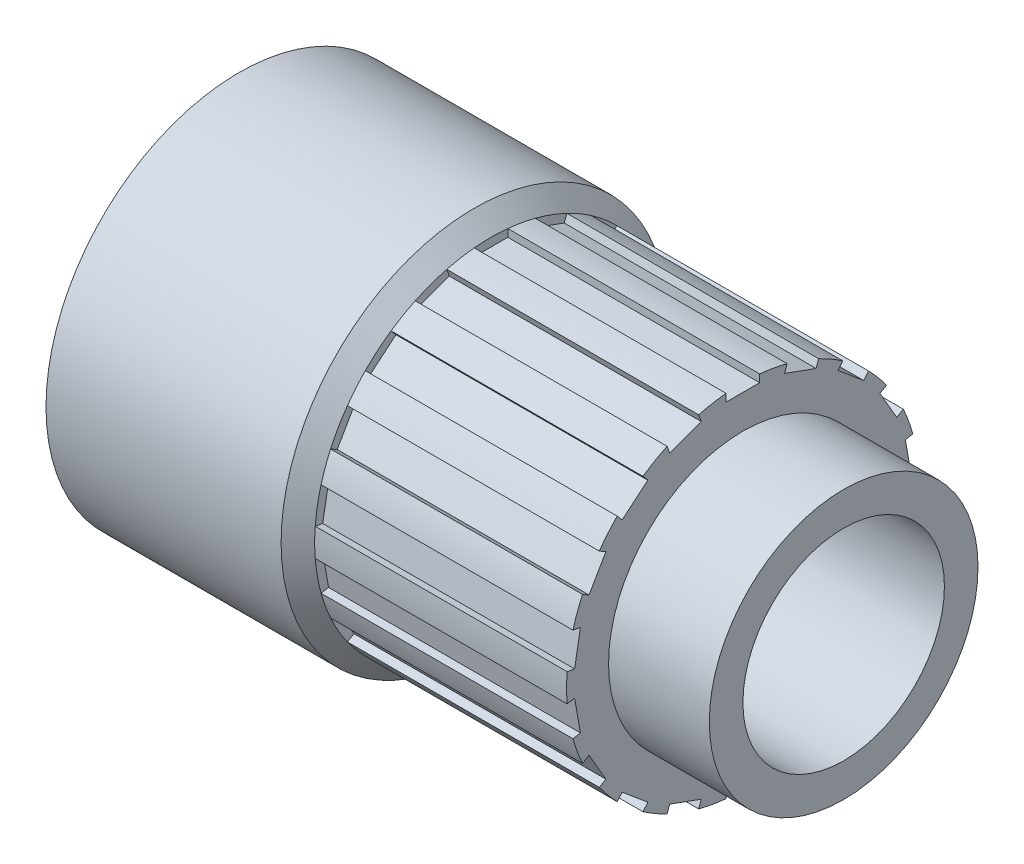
ISO-10303-21;
HEADER;
FILE_DESCRIPTION(('STEP AP214'),'2;1');
FILE_NAME('part.step','',(''),(''),'','','');
FILE_SCHEMA(('AUTOMOTIVE_DESIGN { 1 0 10303 214 1 1 1 1 }'));
ENDSEC;
DATA;
#1=APPLICATION_CONTEXT('core data for automotive mechanical design processes');
#2=APPLICATION_PROTOCOL_DEFINITION('international standard','automotive_design',2000,#1);
#3=PRODUCT_CONTEXT('',#1,'mechanical');
#4=PRODUCT('Part','Part','',(#3));
#5=PRODUCT_RELATED_PRODUCT_CATEGORY('part','',(#4));
#6=PRODUCT_DEFINITION_FORMATION('','',#4);
#7=PRODUCT_DEFINITION_CONTEXT('part definition',#1,'design');
#8=PRODUCT_DEFINITION('design','',#6,#7);
#9=PRODUCT_DEFINITION_SHAPE('','',#8);
#10=(LENGTH_UNIT() NAMED_UNIT(*) SI_UNIT(.MILLI.,.METRE.));
#11=(NAMED_UNIT(*) PLANE_ANGLE_UNIT() SI_UNIT($,.RADIAN.));
#12=(NAMED_UNIT(*) SI_UNIT($,.STERADIAN.) SOLID_ANGLE_UNIT());
#13=UNCERTAINTY_MEASURE_WITH_UNIT(LENGTH_MEASURE(1.E-05),#10,'distance_accuracy_value','');
#14=(GEOMETRIC_REPRESENTATION_CONTEXT(3) GLOBAL_UNCERTAINTY_ASSIGNED_CONTEXT((#13)) GLOBAL_UNIT_ASSIGNED_CONTEXT((#10,
#11,#12)) REPRESENTATION_CONTEXT('',''));
#15=CARTESIAN_POINT('',(0.,0.,0.));
#16=DIRECTION('',(0.,0.,1.));
#17=DIRECTION('',(1.,0.,0.));
#18=AXIS2_PLACEMENT_3D('',#15,#16,#17);
#19=CARTESIAN_POINT('',(-3.5,0.,0.));
#20=DIRECTION('',(-1.,0.,0.));
#21=DIRECTION('',(0.,0.,1.));
#22=AXIS2_PLACEMENT_3D('',#19,#20,#21);
#23=CYLINDRICAL_SURFACE('',#22,5.25);
#24=DIRECTION('',(-1.,0.,0.));
#25=VECTOR('',#24,1.);
#26=CARTESIAN_POINT('',(-3.5,4.7399515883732,-2.25729017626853));
#27=LINE('',#26,#25);
#28=CARTESIAN_POINT('',(14.9999999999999,4.7399515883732,-2.25729017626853));
#29=VERTEX_POINT('',#28);
#30=CARTESIAN_POINT('',(7.49999999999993,4.7399515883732,-2.25729017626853));
#31=VERTEX_POINT('',#30);
#32=EDGE_CURVE('E511',#29,#31,#27,.T.);
#33=ORIENTED_EDGE('',*,*,#32,.F.);
#34=CARTESIAN_POINT('',(15.,0.,0.));
#35=DIRECTION('',(-1.,0.,0.));
#36=DIRECTION('',(0.,0.,1.));
#37=AXIS2_PLACEMENT_3D('',#34,#35,#36);
#38=CIRCLE('',#37,5.25);
#39=CARTESIAN_POINT('',(15.,4.32484643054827,-2.97627340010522));
#40=VERTEX_POINT('',#39);
#41=EDGE_CURVE('E51',#29,#40,#38,.T.);
#42=ORIENTED_EDGE('',*,*,#41,.T.);
#43=DIRECTION('',(-1.,0.,0.));
#44=VECTOR('',#43,1.);
#45=CARTESIAN_POINT('',(-3.5,4.32484643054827,-2.97627340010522));
#46=LINE('',#45,#44);
#47=CARTESIAN_POINT('',(7.49999999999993,4.32484643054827,-2.97627340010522));
#48=VERTEX_POINT('',#47);
#49=EDGE_CURVE('E533',#48,#40,#46,.F.);
#50=ORIENTED_EDGE('',*,*,#49,.F.);
#51=CARTESIAN_POINT('',(7.5,0.,0.));
#52=DIRECTION('',(-1.,0.,0.));
#53=DIRECTION('',(0.,0.,1.));
#54=AXIS2_PLACEMENT_3D('',#51,#52,#53);
#55=CIRCLE('',#54,5.25);
#56=EDGE_CURVE('E963',#31,#48,#55,.T.);
#57=ORIENTED_EDGE('',*,*,#56,.F.);
#58=EDGE_LOOP('',(#33,#42,#50,#57));
#59=FACE_BOUND('',#58,.T.);
#60=ADVANCED_FACE('F28',(#59),#23,.T.);
#61=DIRECTION('',(-1.,0.,0.));
#62=VECTOR('',#61,1.);
#63=CARTESIAN_POINT('',(-3.5,3.68205882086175,-3.74231784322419));
#64=LINE('',#63,#62);
#65=CARTESIAN_POINT('',(14.9999999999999,3.68205882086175,-3.74231784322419));
#66=VERTEX_POINT('',#65);
#67=CARTESIAN_POINT('',(7.49999999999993,3.68205882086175,-3.74231784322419));
#68=VERTEX_POINT('',#67);
#69=EDGE_CURVE('E535',#66,#68,#64,.T.);
#70=ORIENTED_EDGE('',*,*,#69,.F.);
#71=CARTESIAN_POINT('',(15.,3.04608082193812,-4.27596674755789));
#72=VERTEX_POINT('',#71);
#73=EDGE_CURVE('E1105',#66,#72,#38,.T.);
#74=ORIENTED_EDGE('',*,*,#73,.T.);
#75=DIRECTION('',(-1.,0.,0.));
#76=VECTOR('',#75,1.);
#77=CARTESIAN_POINT('',(-3.5,3.04608082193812,-4.27596674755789));
#78=LINE('',#77,#76);
#79=CARTESIAN_POINT('',(7.49999999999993,3.04608082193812,-4.27596674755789));
#80=VERTEX_POINT('',#79);
#81=EDGE_CURVE('E557',#80,#72,#78,.F.);
#82=ORIENTED_EDGE('',*,*,#81,.F.);
#83=EDGE_CURVE('E974',#68,#80,#55,.T.);
#84=ORIENTED_EDGE('',*,*,#83,.F.);
#85=EDGE_LOOP('',(#70,#74,#82,#84));
#86=FACE_BOUND('',#85,.T.);
#87=ADVANCED_FACE('F1103',(#86),#23,.T.);
#88=DIRECTION('',(-1.,0.,0.));
#89=VECTOR('',#88,1.);
#90=CARTESIAN_POINT('',(-3.5,2.1800554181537,-4.77596674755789));
#91=LINE('',#90,#89);
#92=CARTESIAN_POINT('',(14.9999999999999,2.1800554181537,-4.77596674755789));
#93=VERTEX_POINT('',#92);
#94=CARTESIAN_POINT('',(7.49999999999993,2.1800554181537,-4.77596674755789));
#95=VERTEX_POINT('',#94);
#96=EDGE_CURVE('E560',#93,#95,#91,.T.);
#97=ORIENTED_EDGE('',*,*,#96,.F.);
#98=CARTESIAN_POINT('',(15.,1.39991291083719,-5.05991539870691));
#99=VERTEX_POINT('',#98);
#100=EDGE_CURVE('E1108',#93,#99,#38,.T.);
#101=ORIENTED_EDGE('',*,*,#100,.T.);
#102=DIRECTION('',(-1.,0.,0.));
#103=VECTOR('',#102,1.);
#104=CARTESIAN_POINT('',(-3.5,1.39991291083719,-5.05991539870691));
#105=LINE('',#104,#103);
#106=CARTESIAN_POINT('',(7.49999999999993,1.39991291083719,-5.05991539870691));
#107=VERTEX_POINT('',#106);
#108=EDGE_CURVE('E582',#107,#99,#105,.F.);
#109=ORIENTED_EDGE('',*,*,#108,.F.);
#110=EDGE_CURVE('E975',#95,#107,#55,.T.);
#111=ORIENTED_EDGE('',*,*,#110,.F.);
#112=EDGE_LOOP('',(#97,#101,#109,#111));
#113=FACE_BOUND('',#112,.T.);
#114=ADVANCED_FACE('F1221',(#113),#23,.T.);
#115=DIRECTION('',(-1.,0.,0.));
#116=VECTOR('',#115,1.);
#117=CARTESIAN_POINT('',(-3.5,0.415105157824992,-5.23356357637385));
#118=LINE('',#117,#116);
#119=CARTESIAN_POINT('',(14.9999999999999,0.415105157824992,-5.23356357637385));
#120=VERTEX_POINT('',#119);
#121=CARTESIAN_POINT('',(7.49999999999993,0.415105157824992,-5.23356357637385));
#122=VERTEX_POINT('',#121);
#123=EDGE_CURVE('E585',#120,#122,#118,.T.);
#124=ORIENTED_EDGE('',*,*,#123,.F.);
#125=CARTESIAN_POINT('',(15.,-0.415105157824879,-5.23356357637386));
#126=VERTEX_POINT('',#125);
#127=EDGE_CURVE('E1109',#120,#126,#38,.T.);
#128=ORIENTED_EDGE('',*,*,#127,.T.);
#129=DIRECTION('',(-1.,0.,0.));
#130=VECTOR('',#129,1.);
#131=CARTESIAN_POINT('',(-3.5,-0.41510515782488,-5.23356357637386));
#132=LINE('',#131,#130);
#133=CARTESIAN_POINT('',(7.49999999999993,-0.41510515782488,-5.23356357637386));
#134=VERTEX_POINT('',#133);
#135=EDGE_CURVE('E607',#134,#126,#132,.F.);
#136=ORIENTED_EDGE('',*,*,#135,.F.);
#137=EDGE_CURVE('E982',#122,#134,#55,.T.);
#138=ORIENTED_EDGE('',*,*,#137,.F.);
#139=EDGE_LOOP('',(#124,#128,#136,#138));
#140=FACE_BOUND('',#139,.T.);
#141=ADVANCED_FACE('F1744',(#140),#23,.T.);
#142=DIRECTION('',(-1.,0.,0.));
#143=VECTOR('',#142,1.);
#144=CARTESIAN_POINT('',(-3.5,-1.39991291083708,-5.05991539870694));
#145=LINE('',#144,#143);
#146=CARTESIAN_POINT('',(14.9999999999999,-1.39991291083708,-5.05991539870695));
#147=VERTEX_POINT('',#146);
#148=CARTESIAN_POINT('',(7.49999999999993,-1.39991291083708,-5.05991539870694));
#149=VERTEX_POINT('',#148);
#150=EDGE_CURVE('E610',#147,#149,#145,.T.);
#151=ORIENTED_EDGE('',*,*,#150,.F.);
#152=CARTESIAN_POINT('',(15.,-2.1800554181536,-4.77596674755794));
#153=VERTEX_POINT('',#152);
#154=EDGE_CURVE('E1114',#147,#153,#38,.T.);
#155=ORIENTED_EDGE('',*,*,#154,.T.);
#156=DIRECTION('',(-1.,0.,0.));
#157=VECTOR('',#156,1.);
#158=CARTESIAN_POINT('',(-3.5,-2.1800554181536,-4.77596674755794));
#159=LINE('',#158,#157);
#160=CARTESIAN_POINT('',(7.49999999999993,-2.1800554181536,-4.77596674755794));
#161=VERTEX_POINT('',#160);
#162=EDGE_CURVE('E632',#161,#153,#159,.F.);
#163=ORIENTED_EDGE('',*,*,#162,.F.);
#164=EDGE_CURVE('E983',#149,#161,#55,.T.);
#165=ORIENTED_EDGE('',*,*,#164,.F.);
#166=EDGE_LOOP('',(#151,#155,#163,#165));
#167=FACE_BOUND('',#166,.T.);
#168=ADVANCED_FACE('F1753',(#167),#23,.T.);
#169=DIRECTION('',(-1.,0.,0.));
#170=VECTOR('',#169,1.);
#171=CARTESIAN_POINT('',(-3.5,-3.04608082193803,-4.27596674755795));
#172=LINE('',#171,#170);
#173=CARTESIAN_POINT('',(14.9999999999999,-3.04608082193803,-4.27596674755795));
#174=VERTEX_POINT('',#173);
#175=CARTESIAN_POINT('',(7.49999999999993,-3.04608082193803,-4.27596674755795));
#176=VERTEX_POINT('',#175);
#177=EDGE_CURVE('E635',#174,#176,#172,.T.);
#178=ORIENTED_EDGE('',*,*,#177,.F.);
#179=CARTESIAN_POINT('',(15.,-3.68205882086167,-3.74231784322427));
#180=VERTEX_POINT('',#179);
#181=EDGE_CURVE('E1119',#174,#180,#38,.T.);
#182=ORIENTED_EDGE('',*,*,#181,.T.);
#183=DIRECTION('',(-1.,0.,0.));
#184=VECTOR('',#183,1.);
#185=CARTESIAN_POINT('',(-3.5,-3.68205882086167,-3.74231784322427));
#186=LINE('',#185,#184);
#187=CARTESIAN_POINT('',(7.49999999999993,-3.68205882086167,-3.74231784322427));
#188=VERTEX_POINT('',#187);
#189=EDGE_CURVE('E657',#188,#180,#186,.F.);
#190=ORIENTED_EDGE('',*,*,#189,.F.);
#191=EDGE_CURVE('E990',#176,#188,#55,.T.);
#192=ORIENTED_EDGE('',*,*,#191,.F.);
#193=EDGE_LOOP('',(#178,#182,#190,#192));
#194=FACE_BOUND('',#193,.T.);
#195=ADVANCED_FACE('F1762',(#194),#23,.T.);
#196=DIRECTION('',(-1.,0.,0.));
#197=VECTOR('',#196,1.);
#198=CARTESIAN_POINT('',(-3.5,-4.32484643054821,-2.97627340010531));
#199=LINE('',#198,#197);
#200=CARTESIAN_POINT('',(14.9999999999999,-4.32484643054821,-2.97627340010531));
#201=VERTEX_POINT('',#200);
#202=CARTESIAN_POINT('',(7.49999999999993,-4.32484643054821,-2.97627340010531));
#203=VERTEX_POINT('',#202);
#204=EDGE_CURVE('E660',#201,#203,#199,.T.);
#205=ORIENTED_EDGE('',*,*,#204,.F.);
#206=CARTESIAN_POINT('',(15.,-4.73995158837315,-2.25729017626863));
#207=VERTEX_POINT('',#206);
#208=EDGE_CURVE('E1124',#201,#207,#38,.T.);
#209=ORIENTED_EDGE('',*,*,#208,.T.);
#210=DIRECTION('',(-1.,0.,0.));
#211=VECTOR('',#210,1.);
#212=CARTESIAN_POINT('',(-3.5,-4.73995158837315,-2.25729017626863));
#213=LINE('',#212,#211);
#214=CARTESIAN_POINT('',(7.49999999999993,-4.73995158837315,-2.25729017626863));
#215=VERTEX_POINT('',#214);
#216=EDGE_CURVE('E682',#215,#207,#213,.F.);
#217=ORIENTED_EDGE('',*,*,#216,.F.);
#218=EDGE_CURVE('E991',#203,#215,#55,.T.);
#219=ORIENTED_EDGE('',*,*,#218,.F.);
#220=EDGE_LOOP('',(#205,#209,#217,#219));
#221=FACE_BOUND('',#220,.T.);
#222=ADVANCED_FACE('F1771',(#221),#23,.T.);
#223=DIRECTION('',(-1.,0.,0.));
#224=VECTOR('',#223,1.);
#225=CARTESIAN_POINT('',(-3.5,-5.08197173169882,-1.31759755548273));
#226=LINE('',#225,#224);
#227=CARTESIAN_POINT('',(14.9999999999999,-5.08197173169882,-1.31759755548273));
#228=VERTEX_POINT('',#227);
#229=CARTESIAN_POINT('',(7.49999999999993,-5.08197173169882,-1.31759755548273));
#230=VERTEX_POINT('',#229);
#231=EDGE_CURVE('E685',#228,#230,#226,.T.);
#232=ORIENTED_EDGE('',*,*,#231,.F.);
#233=CARTESIAN_POINT('',(15.,-5.22613624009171,-0.500000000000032));
#234=VERTEX_POINT('',#233);
#235=EDGE_CURVE('E1129',#228,#234,#38,.T.);
#236=ORIENTED_EDGE('',*,*,#235,.T.);
#237=DIRECTION('',(-1.,0.,0.));
#238=VECTOR('',#237,1.);
#239=CARTESIAN_POINT('',(-3.5,-5.22613624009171,-0.500000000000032));
#240=LINE('',#239,#238);
#241=CARTESIAN_POINT('',(7.49999999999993,-5.22613624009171,-0.500000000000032));
#242=VERTEX_POINT('',#241);
#243=EDGE_CURVE('E707',#242,#234,#240,.F.);
#244=ORIENTED_EDGE('',*,*,#243,.F.);
#245=EDGE_CURVE('E998',#230,#242,#55,.T.);
#246=ORIENTED_EDGE('',*,*,#245,.F.);
#247=EDGE_LOOP('',(#232,#236,#244,#246));
#248=FACE_BOUND('',#247,.T.);
#249=ADVANCED_FACE('F1780',(#248),#23,.T.);
#250=DIRECTION('',(-1.,0.,0.));
#251=VECTOR('',#250,1.);
#252=CARTESIAN_POINT('',(-3.5,-5.22613624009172,0.499999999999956));
#253=LINE('',#252,#251);
#254=CARTESIAN_POINT('',(14.9999999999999,-5.22613624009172,0.499999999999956));
#255=VERTEX_POINT('',#254);
#256=CARTESIAN_POINT('',(7.49999999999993,-5.22613624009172,0.499999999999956));
#257=VERTEX_POINT('',#256);
#258=EDGE_CURVE('E710',#255,#257,#253,.T.);
#259=ORIENTED_EDGE('',*,*,#258,.F.);
#260=CARTESIAN_POINT('',(15.,-5.08197173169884,1.31759755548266));
#261=VERTEX_POINT('',#260);
#262=EDGE_CURVE('E1134',#255,#261,#38,.T.);
#263=ORIENTED_EDGE('',*,*,#262,.T.);
#264=DIRECTION('',(-1.,0.,0.));
#265=VECTOR('',#264,1.);
#266=CARTESIAN_POINT('',(-3.5,-5.08197173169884,1.31759755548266));
#267=LINE('',#266,#265);
#268=CARTESIAN_POINT('',(7.49999999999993,-5.08197173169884,1.31759755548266));
#269=VERTEX_POINT('',#268);
#270=EDGE_CURVE('E732',#269,#261,#267,.F.);
#271=ORIENTED_EDGE('',*,*,#270,.F.);
#272=EDGE_CURVE('E999',#257,#269,#55,.T.);
#273=ORIENTED_EDGE('',*,*,#272,.F.);
#274=EDGE_LOOP('',(#259,#263,#271,#273));
#275=FACE_BOUND('',#274,.T.);
#276=ADVANCED_FACE('F1789',(#275),#23,.T.);
#277=DIRECTION('',(-1.,0.,0.));
#278=VECTOR('',#277,1.);
#279=CARTESIAN_POINT('',(-3.5,-4.73995158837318,2.25729017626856));
#280=LINE('',#279,#278);
#281=CARTESIAN_POINT('',(14.9999999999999,-4.73995158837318,2.25729017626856));
#282=VERTEX_POINT('',#281);
#283=CARTESIAN_POINT('',(7.49999999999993,-4.73995158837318,2.25729017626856));
#284=VERTEX_POINT('',#283);
#285=EDGE_CURVE('E735',#282,#284,#280,.T.);
#286=ORIENTED_EDGE('',*,*,#285,.F.);
#287=CARTESIAN_POINT('',(15.,-4.32484643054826,2.97627340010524));
#288=VERTEX_POINT('',#287);
#289=EDGE_CURVE('E1139',#282,#288,#38,.T.);
#290=ORIENTED_EDGE('',*,*,#289,.T.);
#291=DIRECTION('',(-1.,0.,0.));
#292=VECTOR('',#291,1.);
#293=CARTESIAN_POINT('',(-3.5,-4.32484643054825,2.97627340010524));
#294=LINE('',#293,#292);
#295=CARTESIAN_POINT('',(7.49999999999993,-4.32484643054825,2.97627340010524));
#296=VERTEX_POINT('',#295);
#297=EDGE_CURVE('E757',#296,#288,#294,.F.);
#298=ORIENTED_EDGE('',*,*,#297,.F.);
#299=EDGE_CURVE('E1006',#284,#296,#55,.T.);
#300=ORIENTED_EDGE('',*,*,#299,.F.);
#301=EDGE_LOOP('',(#286,#290,#298,#300));
#302=FACE_BOUND('',#301,.T.);
#303=ADVANCED_FACE('F1798',(#302),#23,.T.);
#304=DIRECTION('',(-1.,0.,0.));
#305=VECTOR('',#304,1.);
#306=CARTESIAN_POINT('',(-3.5,-3.68205882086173,3.74231784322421));
#307=LINE('',#306,#305);
#308=CARTESIAN_POINT('',(14.9999999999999,-3.68205882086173,3.74231784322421));
#309=VERTEX_POINT('',#308);
#310=CARTESIAN_POINT('',(7.49999999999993,-3.68205882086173,3.74231784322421));
#311=VERTEX_POINT('',#310);
#312=EDGE_CURVE('E760',#309,#311,#307,.T.);
#313=ORIENTED_EDGE('',*,*,#312,.F.);
#314=CARTESIAN_POINT('',(15.,-3.0460808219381,4.27596674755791));
#315=VERTEX_POINT('',#314);
#316=EDGE_CURVE('E1144',#309,#315,#38,.T.);
#317=ORIENTED_EDGE('',*,*,#316,.T.);
#318=DIRECTION('',(-1.,0.,0.));
#319=VECTOR('',#318,1.);
#320=CARTESIAN_POINT('',(-3.5,-3.0460808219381,4.2759667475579));
#321=LINE('',#320,#319);
#322=CARTESIAN_POINT('',(7.49999999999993,-3.0460808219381,4.2759667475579));
#323=VERTEX_POINT('',#322);
#324=EDGE_CURVE('E782',#323,#315,#321,.F.);
#325=ORIENTED_EDGE('',*,*,#324,.F.);
#326=EDGE_CURVE('E1007',#311,#323,#55,.T.);
#327=ORIENTED_EDGE('',*,*,#326,.F.);
#328=EDGE_LOOP('',(#313,#317,#325,#327));
#329=FACE_BOUND('',#328,.T.);
#330=ADVANCED_FACE('F1249',(#329),#23,.T.);
#331=DIRECTION('',(-1.,0.,0.));
#332=VECTOR('',#331,1.);
#333=CARTESIAN_POINT('',(-3.5,-2.18005541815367,4.7759667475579));
#334=LINE('',#333,#332);
#335=CARTESIAN_POINT('',(14.9999999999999,-2.18005541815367,4.7759667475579));
#336=VERTEX_POINT('',#335);
#337=CARTESIAN_POINT('',(7.49999999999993,-2.18005541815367,4.7759667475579));
#338=VERTEX_POINT('',#337);
#339=EDGE_CURVE('E785',#336,#338,#334,.T.);
#340=ORIENTED_EDGE('',*,*,#339,.F.);
#341=CARTESIAN_POINT('',(15.,-1.39991291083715,5.05991539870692));
#342=VERTEX_POINT('',#341);
#343=EDGE_CURVE('E1149',#336,#342,#38,.T.);
#344=ORIENTED_EDGE('',*,*,#343,.T.);
#345=DIRECTION('',(-1.,0.,0.));
#346=VECTOR('',#345,1.);
#347=CARTESIAN_POINT('',(-3.5,-1.39991291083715,5.05991539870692));
#348=LINE('',#347,#346);
#349=CARTESIAN_POINT('',(7.49999999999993,-1.39991291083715,5.05991539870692));
#350=VERTEX_POINT('',#349);
#351=EDGE_CURVE('E807',#350,#342,#348,.F.);
#352=ORIENTED_EDGE('',*,*,#351,.F.);
#353=EDGE_CURVE('E1014',#338,#350,#55,.T.);
#354=ORIENTED_EDGE('',*,*,#353,.F.);
#355=EDGE_LOOP('',(#340,#344,#352,#354));
#356=FACE_BOUND('',#355,.T.);
#357=ADVANCED_FACE('F1245',(#356),#23,.T.);
#358=DIRECTION('',(-1.,0.,0.));
#359=VECTOR('',#358,1.);
#360=CARTESIAN_POINT('',(-3.5,-0.415105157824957,5.23356357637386));
#361=LINE('',#360,#359);
#362=CARTESIAN_POINT('',(14.9999999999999,-0.415105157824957,5.23356357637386));
#363=VERTEX_POINT('',#362);
#364=CARTESIAN_POINT('',(7.49999999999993,-0.415105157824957,5.23356357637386));
#365=VERTEX_POINT('',#364);
#366=EDGE_CURVE('E810',#363,#365,#361,.T.);
#367=ORIENTED_EDGE('',*,*,#366,.F.);
#368=CARTESIAN_POINT('',(15.,0.415105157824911,5.23356357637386));
#369=VERTEX_POINT('',#368);
#370=EDGE_CURVE('E1154',#363,#369,#38,.T.);
#371=ORIENTED_EDGE('',*,*,#370,.T.);
#372=DIRECTION('',(-1.,0.,0.));
#373=VECTOR('',#372,1.);
#374=CARTESIAN_POINT('',(-3.5,0.415105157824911,5.23356357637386));
#375=LINE('',#374,#373);
#376=CARTESIAN_POINT('',(7.49999999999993,0.415105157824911,5.23356357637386));
#377=VERTEX_POINT('',#376);
#378=EDGE_CURVE('E832',#377,#369,#375,.F.);
#379=ORIENTED_EDGE('',*,*,#378,.F.);
#380=EDGE_CURVE('E1015',#365,#377,#55,.T.);
#381=ORIENTED_EDGE('',*,*,#380,.F.);
#382=EDGE_LOOP('',(#367,#371,#379,#381));
#383=FACE_BOUND('',#382,.T.);
#384=ADVANCED_FACE('F1241',(#383),#23,.T.);
#385=DIRECTION('',(-1.,0.,0.));
#386=VECTOR('',#385,1.);
#387=CARTESIAN_POINT('',(-3.5,1.39991291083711,5.05991539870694));
#388=LINE('',#387,#386);
#389=CARTESIAN_POINT('',(14.9999999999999,1.39991291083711,5.05991539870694));
#390=VERTEX_POINT('',#389);
#391=CARTESIAN_POINT('',(7.49999999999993,1.39991291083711,5.05991539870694));
#392=VERTEX_POINT('',#391);
#393=EDGE_CURVE('E835',#390,#392,#388,.T.);
#394=ORIENTED_EDGE('',*,*,#393,.F.);
#395=CARTESIAN_POINT('',(15.,2.18005541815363,4.77596674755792));
#396=VERTEX_POINT('',#395);
#397=EDGE_CURVE('E1054',#390,#396,#38,.T.);
#398=ORIENTED_EDGE('',*,*,#397,.T.);
#399=DIRECTION('',(-1.,0.,0.));
#400=VECTOR('',#399,1.);
#401=CARTESIAN_POINT('',(-3.5,2.18005541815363,4.77596674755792));
#402=LINE('',#401,#400);
#403=CARTESIAN_POINT('',(7.49999999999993,2.18005541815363,4.77596674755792));
#404=VERTEX_POINT('',#403);
#405=EDGE_CURVE('E857',#404,#396,#402,.F.);
#406=ORIENTED_EDGE('',*,*,#405,.F.);
#407=EDGE_CURVE('E1022',#392,#404,#55,.T.);
#408=ORIENTED_EDGE('',*,*,#407,.F.);
#409=EDGE_LOOP('',(#394,#398,#406,#408));
#410=FACE_BOUND('',#409,.T.);
#411=ADVANCED_FACE('F1167',(#410),#23,.T.);
#412=DIRECTION('',(-1.,0.,0.));
#413=VECTOR('',#412,1.);
#414=CARTESIAN_POINT('',(-3.5,3.04608082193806,4.27596674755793));
#415=LINE('',#414,#413);
#416=CARTESIAN_POINT('',(14.9999999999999,3.04608082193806,4.27596674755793));
#417=VERTEX_POINT('',#416);
#418=CARTESIAN_POINT('',(7.49999999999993,3.04608082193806,4.27596674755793));
#419=VERTEX_POINT('',#418);
#420=EDGE_CURVE('E860',#417,#419,#415,.T.);
#421=ORIENTED_EDGE('',*,*,#420,.F.);
#422=CARTESIAN_POINT('',(15.,3.68205882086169,3.74231784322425));
#423=VERTEX_POINT('',#422);
#424=EDGE_CURVE('E1053',#417,#423,#38,.T.);
#425=ORIENTED_EDGE('',*,*,#424,.T.);
#426=DIRECTION('',(-1.,0.,0.));
#427=VECTOR('',#426,1.);
#428=CARTESIAN_POINT('',(-3.5,3.68205882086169,3.74231784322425));
#429=LINE('',#428,#427);
#430=CARTESIAN_POINT('',(7.49999999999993,3.68205882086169,3.74231784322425));
#431=VERTEX_POINT('',#430);
#432=EDGE_CURVE('E882',#431,#423,#429,.F.);
#433=ORIENTED_EDGE('',*,*,#432,.F.);
#434=EDGE_CURVE('E1023',#419,#431,#55,.T.);
#435=ORIENTED_EDGE('',*,*,#434,.F.);
#436=EDGE_LOOP('',(#421,#425,#433,#435));
#437=FACE_BOUND('',#436,.T.);
#438=ADVANCED_FACE('F1189',(#437),#23,.T.);
#439=DIRECTION('',(-1.,0.,0.));
#440=VECTOR('',#439,1.);
#441=CARTESIAN_POINT('',(-3.5,4.32484643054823,2.97627340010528));
#442=LINE('',#441,#440);
#443=CARTESIAN_POINT('',(14.9999999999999,4.32484643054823,2.97627340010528));
#444=VERTEX_POINT('',#443);
#445=CARTESIAN_POINT('',(7.49999999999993,4.32484643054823,2.97627340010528));
#446=VERTEX_POINT('',#445);
#447=EDGE_CURVE('E885',#444,#446,#442,.T.);
#448=ORIENTED_EDGE('',*,*,#447,.F.);
#449=CARTESIAN_POINT('',(15.,4.73995158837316,2.2572901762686));
#450=VERTEX_POINT('',#449);
#451=EDGE_CURVE('E1051',#444,#450,#38,.T.);
#452=ORIENTED_EDGE('',*,*,#451,.T.);
#453=DIRECTION('',(-1.,0.,0.));
#454=VECTOR('',#453,1.);
#455=CARTESIAN_POINT('',(-3.5,4.73995158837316,2.2572901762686));
#456=LINE('',#455,#454);
#457=CARTESIAN_POINT('',(7.49999999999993,4.73995158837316,2.2572901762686));
#458=VERTEX_POINT('',#457);
#459=EDGE_CURVE('E907',#458,#450,#456,.F.);
#460=ORIENTED_EDGE('',*,*,#459,.F.);
#461=EDGE_CURVE('E1030',#446,#458,#55,.T.);
#462=ORIENTED_EDGE('',*,*,#461,.F.);
#463=EDGE_LOOP('',(#448,#452,#460,#462));
#464=FACE_BOUND('',#463,.T.);
#465=ADVANCED_FACE('F1049',(#464),#23,.T.);
#466=DIRECTION('',(-1.,0.,0.));
#467=VECTOR('',#466,1.);
#468=CARTESIAN_POINT('',(-3.5,5.08197173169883,1.3175975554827));
#469=LINE('',#468,#467);
#470=CARTESIAN_POINT('',(14.9999999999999,5.08197173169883,1.3175975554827));
#471=VERTEX_POINT('',#470);
#472=CARTESIAN_POINT('',(7.49999999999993,5.08197173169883,1.3175975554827));
#473=VERTEX_POINT('',#472);
#474=EDGE_CURVE('E910',#471,#473,#469,.T.);
#475=ORIENTED_EDGE('',*,*,#474,.F.);
#476=CARTESIAN_POINT('',(15.,5.22613624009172,0.5));
#477=VERTEX_POINT('',#476);
#478=EDGE_CURVE('E958',#471,#477,#38,.T.);
#479=ORIENTED_EDGE('',*,*,#478,.T.);
#480=DIRECTION('',(-1.,0.,0.));
#481=VECTOR('',#480,1.);
#482=CARTESIAN_POINT('',(-3.5,5.22613624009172,0.5));
#483=LINE('',#482,#481);
#484=CARTESIAN_POINT('',(7.49999999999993,5.22613624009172,0.5));
#485=VERTEX_POINT('',#484);
#486=EDGE_CURVE('E932',#485,#477,#483,.F.);
#487=ORIENTED_EDGE('',*,*,#486,.F.);
#488=EDGE_CURVE('E960',#473,#485,#55,.T.);
#489=ORIENTED_EDGE('',*,*,#488,.F.);
#490=EDGE_LOOP('',(#475,#479,#487,#489));
#491=FACE_BOUND('',#490,.T.);
#492=ADVANCED_FACE('F1059',(#491),#23,.T.);
#493=CARTESIAN_POINT('',(-3.5,0.,0.));
#494=DIRECTION('',(-1.,0.,0.));
#495=DIRECTION('',(0.,0.,1.));
#496=AXIS2_PLACEMENT_3D('',#493,#494,#495);
#497=CYLINDRICAL_SURFACE('',#496,5.75);
#498=CARTESIAN_POINT('',(7.,0.,0.));
#499=DIRECTION('',(-1.,0.,0.));
#500=DIRECTION('',(0.,0.,1.));
#501=AXIS2_PLACEMENT_3D('',#498,#499,#500);
#502=CIRCLE('',#501,5.75);
#503=CARTESIAN_POINT('',(7.,0.,5.75));
#504=VERTEX_POINT('',#503);
#505=EDGE_CURVE('E11',#504,#504,#502,.T.);
#506=ORIENTED_EDGE('',*,*,#505,.T.);
#507=EDGE_LOOP('',(#506));
#508=FACE_BOUND('',#507,.T.);
#509=CARTESIAN_POINT('',(0.,0.,0.));
#510=DIRECTION('',(-1.,0.,0.));
#511=DIRECTION('',(0.,0.,1.));
#512=AXIS2_PLACEMENT_3D('',#509,#510,#511);
#513=CIRCLE('',#512,5.75);
#514=CARTESIAN_POINT('',(0.,0.,5.75));
#515=VERTEX_POINT('',#514);
#516=EDGE_CURVE('E937',#515,#515,#513,.T.);
#517=ORIENTED_EDGE('',*,*,#516,.F.);
#518=EDGE_LOOP('',(#517));
#519=FACE_BOUND('',#518,.T.);
#520=ADVANCED_FACE('F30',(#508,#519),#497,.T.);
#521=CARTESIAN_POINT('',(7.,0.,0.));
#522=DIRECTION('',(-1.,0.,0.));
#523=DIRECTION('',(0.,0.,1.));
#524=AXIS2_PLACEMENT_3D('',#521,#522,#523);
#525=CONICAL_SURFACE('',#524,5.75,0.78539816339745);
#526=CARTESIAN_POINT('',(7.49999999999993,5.22613624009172,-0.499999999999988));
#527=VERTEX_POINT('',#526);
#528=EDGE_CURVE('E36',#485,#527,#55,.T.);
#529=ORIENTED_EDGE('',*,*,#528,.T.);
#530=CARTESIAN_POINT('',(7.49999999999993,5.08197173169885,-1.31759755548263));
#531=VERTEX_POINT('',#530);
#532=EDGE_CURVE('E962',#527,#531,#55,.T.);
#533=ORIENTED_EDGE('',*,*,#532,.T.);
#534=EDGE_CURVE('E967',#531,#31,#55,.T.);
#535=ORIENTED_EDGE('',*,*,#534,.T.);
#536=ORIENTED_EDGE('',*,*,#56,.T.);
#537=EDGE_CURVE('E969',#48,#68,#55,.T.);
#538=ORIENTED_EDGE('',*,*,#537,.T.);
#539=ORIENTED_EDGE('',*,*,#83,.T.);
#540=EDGE_CURVE('E976',#80,#95,#55,.T.);
#541=ORIENTED_EDGE('',*,*,#540,.T.);
#542=ORIENTED_EDGE('',*,*,#110,.T.);
#543=EDGE_CURVE('E977',#107,#122,#55,.T.);
#544=ORIENTED_EDGE('',*,*,#543,.T.);
#545=ORIENTED_EDGE('',*,*,#137,.T.);
#546=EDGE_CURVE('E984',#134,#149,#55,.T.);
#547=ORIENTED_EDGE('',*,*,#546,.T.);
#548=ORIENTED_EDGE('',*,*,#164,.T.);
#549=EDGE_CURVE('E985',#161,#176,#55,.T.);
#550=ORIENTED_EDGE('',*,*,#549,.T.);
#551=ORIENTED_EDGE('',*,*,#191,.T.);
#552=EDGE_CURVE('E992',#188,#203,#55,.T.);
#553=ORIENTED_EDGE('',*,*,#552,.T.);
#554=ORIENTED_EDGE('',*,*,#218,.T.);
#555=EDGE_CURVE('E993',#215,#230,#55,.T.);
#556=ORIENTED_EDGE('',*,*,#555,.T.);
#557=ORIENTED_EDGE('',*,*,#245,.T.);
#558=EDGE_CURVE('E1000',#242,#257,#55,.T.);
#559=ORIENTED_EDGE('',*,*,#558,.T.);
#560=ORIENTED_EDGE('',*,*,#272,.T.);
#561=EDGE_CURVE('E1001',#269,#284,#55,.T.);
#562=ORIENTED_EDGE('',*,*,#561,.T.);
#563=ORIENTED_EDGE('',*,*,#299,.T.);
#564=EDGE_CURVE('E1008',#296,#311,#55,.T.);
#565=ORIENTED_EDGE('',*,*,#564,.T.);
#566=ORIENTED_EDGE('',*,*,#326,.T.);
#567=EDGE_CURVE('E1009',#323,#338,#55,.T.);
#568=ORIENTED_EDGE('',*,*,#567,.T.);
#569=ORIENTED_EDGE('',*,*,#353,.T.);
#570=EDGE_CURVE('E1016',#350,#365,#55,.T.);
#571=ORIENTED_EDGE('',*,*,#570,.T.);
#572=ORIENTED_EDGE('',*,*,#380,.T.);
#573=EDGE_CURVE('E1017',#377,#392,#55,.T.);
#574=ORIENTED_EDGE('',*,*,#573,.T.);
#575=ORIENTED_EDGE('',*,*,#407,.T.);
#576=EDGE_CURVE('E1024',#404,#419,#55,.T.);
#577=ORIENTED_EDGE('',*,*,#576,.T.);
#578=ORIENTED_EDGE('',*,*,#434,.T.);
#579=EDGE_CURVE('E1025',#431,#446,#55,.T.);
#580=ORIENTED_EDGE('',*,*,#579,.T.);
#581=ORIENTED_EDGE('',*,*,#461,.T.);
#582=EDGE_CURVE('E968',#458,#473,#55,.T.);
#583=ORIENTED_EDGE('',*,*,#582,.T.);
#584=ORIENTED_EDGE('',*,*,#488,.T.);
#585=EDGE_LOOP('',(#529,#533,#535,#536,#538,#539,#541,#542,#544,#545,#547,#548,#550,#551,#553,
#554,#556,#557,#559,#560,#562,#563,#565,#566,#568,#569,#571,#572,#574,#575,#577,#578,#580,#581,
#583,#584));
#586=FACE_BOUND('',#585,.T.);
#587=ORIENTED_EDGE('',*,*,#505,.F.);
#588=EDGE_LOOP('',(#587));
#589=FACE_BOUND('',#588,.T.);
#590=ADVANCED_FACE('F1034',(#586,#589),#525,.T.);
#591=DIRECTION('',(-1.,0.,0.));
#592=VECTOR('',#591,1.);
#593=CARTESIAN_POINT('',(-3.5,5.08197173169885,-1.31759755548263));
#594=LINE('',#593,#592);
#595=CARTESIAN_POINT('',(15.,5.08197173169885,-1.31759755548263));
#596=VERTEX_POINT('',#595);
#597=EDGE_CURVE('E43',#531,#596,#594,.F.);
#598=ORIENTED_EDGE('',*,*,#597,.F.);
#599=ORIENTED_EDGE('',*,*,#532,.F.);
#600=DIRECTION('',(-1.,0.,0.));
#601=VECTOR('',#600,1.);
#602=CARTESIAN_POINT('',(-3.5,5.22613624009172,-0.499999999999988));
#603=LINE('',#602,#601);
#604=CARTESIAN_POINT('',(14.9999999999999,5.22613624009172,-0.499999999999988));
#605=VERTEX_POINT('',#604);
#606=EDGE_CURVE('E935',#605,#527,#603,.T.);
#607=ORIENTED_EDGE('',*,*,#606,.F.);
#608=EDGE_CURVE('E959',#605,#596,#38,.T.);
#609=ORIENTED_EDGE('',*,*,#608,.T.);
#610=EDGE_LOOP('',(#598,#599,#607,#609));
#611=FACE_BOUND('',#610,.T.);
#612=ADVANCED_FACE('F1079',(#611),#23,.T.);
#613=CARTESIAN_POINT('',(14.9999999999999,4.,0.));
#614=DIRECTION('',(-1.,0.,0.));
#615=DIRECTION('',(0.,0.,1.));
#616=AXIS2_PLACEMENT_3D('',#613,#614,#615);
#617=PLANE('',#616);
#618=ORIENTED_EDGE('',*,*,#41,.F.);
#619=DIRECTION('',(0.,0.939692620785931,-0.342020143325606));
#620=VECTOR('',#619,1.);
#621=CARTESIAN_POINT('',(14.9999999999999,4.52745303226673,-2.17994702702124));
#622=LINE('',#621,#620);
#623=CARTESIAN_POINT('',(14.9999999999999,4.52745303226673,-2.17994702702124));
#624=VERTEX_POINT('',#623);
#625=EDGE_CURVE('E500',#624,#29,#622,.T.);
#626=ORIENTED_EDGE('',*,*,#625,.F.);
#627=DIRECTION('',(0.,-0.342020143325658,-0.939692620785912));
#628=VECTOR('',#627,1.);
#629=CARTESIAN_POINT('',(14.9999999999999,4.86947317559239,-1.24025440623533));
#630=LINE('',#629,#628);
#631=CARTESIAN_POINT('',(14.9999999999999,4.86947317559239,-1.24025440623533));
#632=VERTEX_POINT('',#631);
#633=EDGE_CURVE('E487',#632,#624,#630,.T.);
#634=ORIENTED_EDGE('',*,*,#633,.F.);
#635=DIRECTION('',(0.,-0.939692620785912,0.342020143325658));
#636=VECTOR('',#635,1.);
#637=CARTESIAN_POINT('',(14.9999999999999,5.33931948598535,-1.41126447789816));
#638=LINE('',#637,#636);
#639=EDGE_CURVE('E478',#596,#632,#638,.T.);
#640=ORIENTED_EDGE('',*,*,#639,.F.);
#641=ORIENTED_EDGE('',*,*,#608,.F.);
#642=DIRECTION('',(0.,1.,0.));
#643=VECTOR('',#642,1.);
#644=CARTESIAN_POINT('',(14.9999999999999,5.,-0.5));
#645=LINE('',#644,#643);
#646=CARTESIAN_POINT('',(14.9999999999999,5.,-0.5));
#647=VERTEX_POINT('',#646);
#648=EDGE_CURVE('E917',#647,#605,#645,.T.);
#649=ORIENTED_EDGE('',*,*,#648,.F.);
#650=DIRECTION('',(0.,0.,-1.));
#651=VECTOR('',#650,1.);
#652=CARTESIAN_POINT('',(14.9999999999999,5.,0.5));
#653=LINE('',#652,#651);
#654=CARTESIAN_POINT('',(14.9999999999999,5.,0.5));
#655=VERTEX_POINT('',#654);
#656=EDGE_CURVE('E914',#655,#647,#653,.T.);
#657=ORIENTED_EDGE('',*,*,#656,.F.);
#658=DIRECTION('',(0.,-1.,0.));
#659=VECTOR('',#658,1.);
#660=CARTESIAN_POINT('',(14.9999999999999,5.5,0.5));
#661=LINE('',#660,#659);
#662=EDGE_CURVE('E912',#477,#655,#661,.T.);
#663=ORIENTED_EDGE('',*,*,#662,.F.);
#664=ORIENTED_EDGE('',*,*,#478,.F.);
#665=DIRECTION('',(0.,0.939692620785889,0.342020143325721));
#666=VECTOR('',#665,1.);
#667=CARTESIAN_POINT('',(14.9999999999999,4.86947317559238,1.24025440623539));
#668=LINE('',#667,#666);
#669=CARTESIAN_POINT('',(14.9999999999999,4.86947317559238,1.24025440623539));
#670=VERTEX_POINT('',#669);
#671=EDGE_CURVE('E892',#670,#471,#668,.T.);
#672=ORIENTED_EDGE('',*,*,#671,.F.);
#673=DIRECTION('',(0.,0.342020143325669,-0.939692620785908));
#674=VECTOR('',#673,1.);
#675=CARTESIAN_POINT('',(14.9999999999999,4.52745303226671,2.1799470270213));
#676=LINE('',#675,#674);
#677=CARTESIAN_POINT('',(14.9999999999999,4.52745303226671,2.1799470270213));
#678=VERTEX_POINT('',#677);
#679=EDGE_CURVE('E889',#678,#670,#676,.T.);
#680=ORIENTED_EDGE('',*,*,#679,.F.);
#681=DIRECTION('',(0.,-0.939692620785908,-0.342020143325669));
#682=VECTOR('',#681,1.);
#683=CARTESIAN_POINT('',(14.9999999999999,4.99729934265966,2.35095709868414));
#684=LINE('',#683,#682);
#685=EDGE_CURVE('E887',#450,#678,#684,.T.);
#686=ORIENTED_EDGE('',*,*,#685,.F.);
#687=ORIENTED_EDGE('',*,*,#451,.F.);
#688=DIRECTION('',(0.,0.766044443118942,0.642787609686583));
#689=VECTOR('',#688,1.);
#690=CARTESIAN_POINT('',(14.9999999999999,4.15161602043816,2.83091582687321));
#691=LINE('',#690,#689);
#692=CARTESIAN_POINT('',(14.9999999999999,4.15161602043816,2.83091582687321));
#693=VERTEX_POINT('',#692);
#694=EDGE_CURVE('E867',#693,#444,#691,.T.);
#695=ORIENTED_EDGE('',*,*,#694,.F.);
#696=DIRECTION('',(0.,0.64278760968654,-0.766044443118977));
#697=VECTOR('',#696,1.);
#698=CARTESIAN_POINT('',(14.9999999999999,3.50882841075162,3.59696026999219));
#699=LINE('',#698,#697);
#700=CARTESIAN_POINT('',(14.9999999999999,3.50882841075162,3.59696026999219));
#701=VERTEX_POINT('',#700);
#702=EDGE_CURVE('E864',#701,#693,#699,.T.);
#703=ORIENTED_EDGE('',*,*,#702,.F.);
#704=DIRECTION('',(0.,-0.766044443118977,-0.64278760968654));
#705=VECTOR('',#704,1.);
#706=CARTESIAN_POINT('',(14.9999999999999,3.8918506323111,3.91835407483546));
#707=LINE('',#706,#705);
#708=EDGE_CURVE('E862',#423,#701,#707,.T.);
#709=ORIENTED_EDGE('',*,*,#708,.F.);
#710=ORIENTED_EDGE('',*,*,#424,.F.);
#711=DIRECTION('',(0.,0.49999999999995,0.866025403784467));
#712=VECTOR('',#711,1.);
#713=CARTESIAN_POINT('',(14.9999999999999,2.93301270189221,4.0801270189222));
#714=LINE('',#713,#712);
#715=CARTESIAN_POINT('',(14.9999999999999,2.93301270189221,4.0801270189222));
#716=VERTEX_POINT('',#715);
#717=EDGE_CURVE('E842',#716,#417,#714,.T.);
#718=ORIENTED_EDGE('',*,*,#717,.F.);
#719=DIRECTION('',(0.,0.86602540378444,-0.499999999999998));
#720=VECTOR('',#719,1.);
#721=CARTESIAN_POINT('',(14.9999999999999,2.06698729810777,4.5801270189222));
#722=LINE('',#721,#720);
#723=CARTESIAN_POINT('',(14.9999999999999,2.06698729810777,4.5801270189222));
#724=VERTEX_POINT('',#723);
#725=EDGE_CURVE('E839',#724,#716,#722,.T.);
#726=ORIENTED_EDGE('',*,*,#725,.F.);
#727=DIRECTION('',(0.,-0.499999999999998,-0.86602540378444));
#728=VECTOR('',#727,1.);
#729=CARTESIAN_POINT('',(14.9999999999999,2.31698729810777,5.01313972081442));
#730=LINE('',#729,#728);
#731=EDGE_CURVE('E837',#396,#724,#730,.T.);
#732=ORIENTED_EDGE('',*,*,#731,.F.);
#733=ORIENTED_EDGE('',*,*,#397,.F.);
#734=DIRECTION('',(0.,0.173648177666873,0.984807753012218));
#735=VECTOR('',#734,1.);
#736=CARTESIAN_POINT('',(14.9999999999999,1.36064476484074,4.83721467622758));
#737=LINE('',#736,#735);
#738=CARTESIAN_POINT('',(14.9999999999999,1.36064476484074,4.83721467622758));
#739=VERTEX_POINT('',#738);
#740=EDGE_CURVE('E817',#739,#390,#737,.T.);
#741=ORIENTED_EDGE('',*,*,#740,.F.);
#742=DIRECTION('',(0.,0.984807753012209,-0.173648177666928));
#743=VECTOR('',#742,1.);
#744=CARTESIAN_POINT('',(14.9999999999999,0.375837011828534,5.01086285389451));
#745=LINE('',#744,#743);
#746=CARTESIAN_POINT('',(14.9999999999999,0.375837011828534,5.01086285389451));
#747=VERTEX_POINT('',#746);
#748=EDGE_CURVE('E814',#747,#739,#745,.T.);
#749=ORIENTED_EDGE('',*,*,#748,.F.);
#750=DIRECTION('',(0.,-0.173648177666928,-0.984807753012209));
#751=VECTOR('',#750,1.);
#752=CARTESIAN_POINT('',(14.9999999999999,0.462661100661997,5.50326673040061));
#753=LINE('',#752,#751);
#754=EDGE_CURVE('E812',#369,#747,#753,.T.);
#755=ORIENTED_EDGE('',*,*,#754,.F.);
#756=ORIENTED_EDGE('',*,*,#370,.F.);
#757=DIRECTION('',(0.,-0.173648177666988,0.984807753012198));
#758=VECTOR('',#757,1.);
#759=CARTESIAN_POINT('',(14.9999999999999,-0.375837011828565,5.0108628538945));
#760=LINE('',#759,#758);
#761=CARTESIAN_POINT('',(14.9999999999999,-0.375837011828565,5.0108628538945));
#762=VERTEX_POINT('',#761);
#763=EDGE_CURVE('E792',#762,#363,#760,.T.);
#764=ORIENTED_EDGE('',*,*,#763,.F.);
#765=DIRECTION('',(0.,0.984807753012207,0.173648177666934));
#766=VECTOR('',#765,1.);
#767=CARTESIAN_POINT('',(14.9999999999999,-1.36064476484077,4.83721467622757));
#768=LINE('',#767,#766);
#769=CARTESIAN_POINT('',(14.9999999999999,-1.36064476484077,4.83721467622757));
#770=VERTEX_POINT('',#769);
#771=EDGE_CURVE('E789',#770,#762,#768,.T.);
#772=ORIENTED_EDGE('',*,*,#771,.F.);
#773=DIRECTION('',(0.,0.173648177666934,-0.984807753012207));
#774=VECTOR('',#773,1.);
#775=CARTESIAN_POINT('',(14.9999999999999,-1.44746885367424,5.32961855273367));
#776=LINE('',#775,#774);
#777=EDGE_CURVE('E787',#342,#770,#776,.T.);
#778=ORIENTED_EDGE('',*,*,#777,.F.);
#779=ORIENTED_EDGE('',*,*,#343,.F.);
#780=DIRECTION('',(0.,-0.500000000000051,0.866025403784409));
#781=VECTOR('',#780,1.);
#782=CARTESIAN_POINT('',(14.9999999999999,-2.0669872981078,4.58012701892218));
#783=LINE('',#782,#781);
#784=CARTESIAN_POINT('',(14.9999999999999,-2.0669872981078,4.58012701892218));
#785=VERTEX_POINT('',#784);
#786=EDGE_CURVE('E767',#785,#336,#783,.T.);
#787=ORIENTED_EDGE('',*,*,#786,.F.);
#788=DIRECTION('',(0.,0.866025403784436,0.500000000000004));
#789=VECTOR('',#788,1.);
#790=CARTESIAN_POINT('',(14.9999999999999,-2.93301270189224,4.08012701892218));
#791=LINE('',#790,#789);
#792=CARTESIAN_POINT('',(14.9999999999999,-2.93301270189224,4.08012701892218));
#793=VERTEX_POINT('',#792);
#794=EDGE_CURVE('E764',#793,#785,#791,.T.);
#795=ORIENTED_EDGE('',*,*,#794,.F.);
#796=DIRECTION('',(0.,0.500000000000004,-0.866025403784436));
#797=VECTOR('',#796,1.);
#798=CARTESIAN_POINT('',(14.9999999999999,-3.18301270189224,4.5131397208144));
#799=LINE('',#798,#797);
#800=EDGE_CURVE('E762',#315,#793,#799,.T.);
#801=ORIENTED_EDGE('',*,*,#800,.F.);
#802=ORIENTED_EDGE('',*,*,#316,.F.);
#803=DIRECTION('',(0.,-0.766044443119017,0.642787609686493));
#804=VECTOR('',#803,1.);
#805=CARTESIAN_POINT('',(14.9999999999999,-3.50882841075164,3.59696026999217));
#806=LINE('',#805,#804);
#807=CARTESIAN_POINT('',(14.9999999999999,-3.50882841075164,3.59696026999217));
#808=VERTEX_POINT('',#807);
#809=EDGE_CURVE('E742',#808,#309,#806,.T.);
#810=ORIENTED_EDGE('',*,*,#809,.F.);
#811=DIRECTION('',(0.,0.642787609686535,0.766044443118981));
#812=VECTOR('',#811,1.);
#813=CARTESIAN_POINT('',(14.9999999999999,-4.15161602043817,2.83091582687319));
#814=LINE('',#813,#812);
#815=CARTESIAN_POINT('',(14.9999999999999,-4.15161602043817,2.83091582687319));
#816=VERTEX_POINT('',#815);
#817=EDGE_CURVE('E739',#816,#808,#814,.T.);
#818=ORIENTED_EDGE('',*,*,#817,.F.);
#819=DIRECTION('',(0.,0.766044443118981,-0.642787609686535));
#820=VECTOR('',#819,1.);
#821=CARTESIAN_POINT('',(14.9999999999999,-4.53463824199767,3.15230963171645));
#822=LINE('',#821,#820);
#823=EDGE_CURVE('E737',#288,#816,#822,.T.);
#824=ORIENTED_EDGE('',*,*,#823,.F.);
#825=ORIENTED_EDGE('',*,*,#289,.F.);
#826=DIRECTION('',(0.,-0.939692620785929,0.342020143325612));
#827=VECTOR('',#826,1.);
#828=CARTESIAN_POINT('',(14.9999999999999,-4.52745303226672,2.17994702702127));
#829=LINE('',#828,#827);
#830=CARTESIAN_POINT('',(14.9999999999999,-4.52745303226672,2.17994702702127));
#831=VERTEX_POINT('',#830);
#832=EDGE_CURVE('E717',#831,#282,#829,.T.);
#833=ORIENTED_EDGE('',*,*,#832,.F.);
#834=DIRECTION('',(0.,0.342020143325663,0.93969262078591));
#835=VECTOR('',#834,1.);
#836=CARTESIAN_POINT('',(14.9999999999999,-4.86947317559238,1.24025440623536));
#837=LINE('',#836,#835);
#838=CARTESIAN_POINT('',(14.9999999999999,-4.86947317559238,1.24025440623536));
#839=VERTEX_POINT('',#838);
#840=EDGE_CURVE('E714',#839,#831,#837,.T.);
#841=ORIENTED_EDGE('',*,*,#840,.F.);
#842=DIRECTION('',(0.,0.93969262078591,-0.342020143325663));
#843=VECTOR('',#842,1.);
#844=CARTESIAN_POINT('',(14.9999999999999,-5.33931948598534,1.41126447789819));
#845=LINE('',#844,#843);
#846=EDGE_CURVE('E712',#261,#839,#845,.T.);
#847=ORIENTED_EDGE('',*,*,#846,.F.);
#848=ORIENTED_EDGE('',*,*,#262,.F.);
#849=DIRECTION('',(0.,-1.,0.));
#850=VECTOR('',#849,1.);
#851=CARTESIAN_POINT('',(14.9999999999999,-5.,0.49999999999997));
#852=LINE('',#851,#850);
#853=CARTESIAN_POINT('',(14.9999999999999,-5.,0.49999999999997));
#854=VERTEX_POINT('',#853);
#855=EDGE_CURVE('E692',#854,#255,#852,.T.);
#856=ORIENTED_EDGE('',*,*,#855,.F.);
#857=DIRECTION('',(0.,0.,1.));
#858=VECTOR('',#857,1.);
#859=CARTESIAN_POINT('',(14.9999999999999,-5.,-0.500000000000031));
#860=LINE('',#859,#858);
#861=CARTESIAN_POINT('',(14.9999999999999,-5.,-0.500000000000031));
#862=VERTEX_POINT('',#861);
#863=EDGE_CURVE('E689',#862,#854,#860,.T.);
#864=ORIENTED_EDGE('',*,*,#863,.F.);
#865=DIRECTION('',(0.,1.,0.));
#866=VECTOR('',#865,1.);
#867=CARTESIAN_POINT('',(14.9999999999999,-5.5,-0.500000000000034));
#868=LINE('',#867,#866);
#869=EDGE_CURVE('E687',#234,#862,#868,.T.);
#870=ORIENTED_EDGE('',*,*,#869,.F.);
#871=ORIENTED_EDGE('',*,*,#235,.F.);
#872=DIRECTION('',(0.,-0.939692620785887,-0.342020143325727));
#873=VECTOR('',#872,1.);
#874=CARTESIAN_POINT('',(14.9999999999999,-4.86947317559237,-1.24025440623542));
#875=LINE('',#874,#873);
#876=CARTESIAN_POINT('',(14.9999999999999,-4.86947317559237,-1.24025440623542));
#877=VERTEX_POINT('',#876);
#878=EDGE_CURVE('E667',#877,#228,#875,.T.);
#879=ORIENTED_EDGE('',*,*,#878,.F.);
#880=DIRECTION('',(0.,-0.342020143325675,0.939692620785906));
#881=VECTOR('',#880,1.);
#882=CARTESIAN_POINT('',(14.9999999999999,-4.52745303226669,-2.17994702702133));
#883=LINE('',#882,#881);
#884=CARTESIAN_POINT('',(14.9999999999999,-4.52745303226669,-2.17994702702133));
#885=VERTEX_POINT('',#884);
#886=EDGE_CURVE('E664',#885,#877,#883,.T.);
#887=ORIENTED_EDGE('',*,*,#886,.F.);
#888=DIRECTION('',(0.,0.939692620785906,0.342020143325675));
#889=VECTOR('',#888,1.);
#890=CARTESIAN_POINT('',(14.9999999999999,-4.99729934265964,-2.35095709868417));
#891=LINE('',#890,#889);
#892=EDGE_CURVE('E662',#207,#885,#891,.T.);
#893=ORIENTED_EDGE('',*,*,#892,.F.);
#894=ORIENTED_EDGE('',*,*,#208,.F.);
#895=DIRECTION('',(0.,-0.766044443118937,-0.642787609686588));
#896=VECTOR('',#895,1.);
#897=CARTESIAN_POINT('',(14.9999999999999,-4.15161602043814,-2.83091582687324));
#898=LINE('',#897,#896);
#899=CARTESIAN_POINT('',(14.9999999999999,-4.15161602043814,-2.83091582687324));
#900=VERTEX_POINT('',#899);
#901=EDGE_CURVE('E642',#900,#201,#898,.T.);
#902=ORIENTED_EDGE('',*,*,#901,.F.);
#903=DIRECTION('',(0.,-0.642787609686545,0.766044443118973));
#904=VECTOR('',#903,1.);
#905=CARTESIAN_POINT('',(14.9999999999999,-3.50882841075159,-3.59696026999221));
#906=LINE('',#905,#904);
#907=CARTESIAN_POINT('',(14.9999999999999,-3.50882841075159,-3.59696026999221));
#908=VERTEX_POINT('',#907);
#909=EDGE_CURVE('E639',#908,#900,#906,.T.);
#910=ORIENTED_EDGE('',*,*,#909,.F.);
#911=DIRECTION('',(0.,0.766044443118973,0.642787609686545));
#912=VECTOR('',#911,1.);
#913=CARTESIAN_POINT('',(14.9999999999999,-3.89185063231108,-3.91835407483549));
#914=LINE('',#913,#912);
#915=EDGE_CURVE('E637',#180,#908,#914,.T.);
#916=ORIENTED_EDGE('',*,*,#915,.F.);
#917=ORIENTED_EDGE('',*,*,#181,.F.);
#918=DIRECTION('',(0.,-0.499999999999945,-0.86602540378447));
#919=VECTOR('',#918,1.);
#920=CARTESIAN_POINT('',(14.9999999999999,-2.93301270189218,-4.08012701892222));
#921=LINE('',#920,#919);
#922=CARTESIAN_POINT('',(14.9999999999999,-2.93301270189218,-4.08012701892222));
#923=VERTEX_POINT('',#922);
#924=EDGE_CURVE('E617',#923,#174,#921,.T.);
#925=ORIENTED_EDGE('',*,*,#924,.F.);
#926=DIRECTION('',(0.,-0.866025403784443,0.499999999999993));
#927=VECTOR('',#926,1.);
#928=CARTESIAN_POINT('',(14.9999999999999,-2.06698729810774,-4.58012701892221));
#929=LINE('',#928,#927);
#930=CARTESIAN_POINT('',(14.9999999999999,-2.06698729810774,-4.58012701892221));
#931=VERTEX_POINT('',#930);
#932=EDGE_CURVE('E614',#931,#923,#929,.T.);
#933=ORIENTED_EDGE('',*,*,#932,.F.);
#934=DIRECTION('',(0.,0.499999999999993,0.866025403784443));
#935=VECTOR('',#934,1.);
#936=CARTESIAN_POINT('',(14.9999999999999,-2.31698729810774,-5.01313972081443));
#937=LINE('',#936,#935);
#938=EDGE_CURVE('E612',#153,#931,#937,.T.);
#939=ORIENTED_EDGE('',*,*,#938,.F.);
#940=ORIENTED_EDGE('',*,*,#154,.F.);
#941=DIRECTION('',(0.,-0.173648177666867,-0.984807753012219));
#942=VECTOR('',#941,1.);
#943=CARTESIAN_POINT('',(14.9999999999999,-1.36064476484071,-4.83721467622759));
#944=LINE('',#943,#942);
#945=CARTESIAN_POINT('',(14.9999999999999,-1.36064476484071,-4.83721467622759));
#946=VERTEX_POINT('',#945);
#947=EDGE_CURVE('E592',#946,#147,#944,.T.);
#948=ORIENTED_EDGE('',*,*,#947,.F.);
#949=DIRECTION('',(0.,-0.98480775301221,0.173648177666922));
#950=VECTOR('',#949,1.);
#951=CARTESIAN_POINT('',(14.9999999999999,-0.375837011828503,-5.01086285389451));
#952=LINE('',#951,#950);
#953=CARTESIAN_POINT('',(14.9999999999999,-0.375837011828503,-5.01086285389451));
#954=VERTEX_POINT('',#953);
#955=EDGE_CURVE('E589',#954,#946,#952,.T.);
#956=ORIENTED_EDGE('',*,*,#955,.F.);
#957=DIRECTION('',(0.,0.173648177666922,0.98480775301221));
#958=VECTOR('',#957,1.);
#959=CARTESIAN_POINT('',(14.9999999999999,-0.462661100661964,-5.50326673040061));
#960=LINE('',#959,#958);
#961=EDGE_CURVE('E587',#126,#954,#960,.T.);
#962=ORIENTED_EDGE('',*,*,#961,.F.);
#963=ORIENTED_EDGE('',*,*,#127,.F.);
#964=DIRECTION('',(0.,0.173648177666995,-0.984807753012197));
#965=VECTOR('',#964,1.);
#966=CARTESIAN_POINT('',(14.9999999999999,0.375837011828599,-5.0108628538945));
#967=LINE('',#966,#965);
#968=CARTESIAN_POINT('',(14.9999999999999,0.375837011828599,-5.0108628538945));
#969=VERTEX_POINT('',#968);
#970=EDGE_CURVE('E567',#969,#120,#967,.T.);
#971=ORIENTED_EDGE('',*,*,#970,.F.);
#972=DIRECTION('',(0.,-0.984807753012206,-0.17364817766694));
#973=VECTOR('',#972,1.);
#974=CARTESIAN_POINT('',(14.9999999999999,1.36064476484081,-4.83721467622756));
#975=LINE('',#974,#973);
#976=CARTESIAN_POINT('',(14.9999999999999,1.36064476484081,-4.83721467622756));
#977=VERTEX_POINT('',#976);
#978=EDGE_CURVE('E564',#977,#969,#975,.T.);
#979=ORIENTED_EDGE('',*,*,#978,.F.);
#980=DIRECTION('',(0.,-0.17364817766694,0.984807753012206));
#981=VECTOR('',#980,1.);
#982=CARTESIAN_POINT('',(14.9999999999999,1.44746885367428,-5.32961855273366));
#983=LINE('',#982,#981);
#984=EDGE_CURVE('E562',#99,#977,#983,.T.);
#985=ORIENTED_EDGE('',*,*,#984,.F.);
#986=ORIENTED_EDGE('',*,*,#100,.F.);
#987=DIRECTION('',(0.,0.500000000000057,-0.866025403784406));
#988=VECTOR('',#987,1.);
#989=CARTESIAN_POINT('',(14.9999999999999,2.06698729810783,-4.58012701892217));
#990=LINE('',#989,#988);
#991=CARTESIAN_POINT('',(14.9999999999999,2.06698729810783,-4.58012701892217));
#992=VERTEX_POINT('',#991);
#993=EDGE_CURVE('E542',#992,#93,#990,.T.);
#994=ORIENTED_EDGE('',*,*,#993,.F.);
#995=DIRECTION('',(0.,-0.866025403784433,-0.500000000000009));
#996=VECTOR('',#995,1.);
#997=CARTESIAN_POINT('',(14.9999999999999,2.93301270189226,-4.08012701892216));
#998=LINE('',#997,#996);
#999=CARTESIAN_POINT('',(14.9999999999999,2.93301270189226,-4.08012701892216));
#1000=VERTEX_POINT('',#999);
#1001=EDGE_CURVE('E539',#1000,#992,#998,.T.);
#1002=ORIENTED_EDGE('',*,*,#1001,.F.);
#1003=DIRECTION('',(0.,-0.500000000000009,0.866025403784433));
#1004=VECTOR('',#1003,1.);
#1005=CARTESIAN_POINT('',(14.9999999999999,3.18301270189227,-4.51313972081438));
#1006=LINE('',#1005,#1004);
#1007=EDGE_CURVE('E537',#72,#1000,#1006,.T.);
#1008=ORIENTED_EDGE('',*,*,#1007,.F.);
#1009=ORIENTED_EDGE('',*,*,#73,.F.);
#1010=DIRECTION('',(0.,0.766044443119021,-0.642787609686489));
#1011=VECTOR('',#1010,1.);
#1012=CARTESIAN_POINT('',(14.9999999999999,3.50882841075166,-3.59696026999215));
#1013=LINE('',#1012,#1011);
#1014=CARTESIAN_POINT('',(14.9999999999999,3.50882841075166,-3.59696026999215));
#1015=VERTEX_POINT('',#1014);
#1016=EDGE_CURVE('E518',#1015,#66,#1013,.T.);
#1017=ORIENTED_EDGE('',*,*,#1016,.F.);
#1018=DIRECTION('',(0.,-0.642787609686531,-0.766044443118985));
#1019=VECTOR('',#1018,1.);
#1020=CARTESIAN_POINT('',(14.9999999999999,4.15161602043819,-2.83091582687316));
#1021=LINE('',#1020,#1019);
#1022=CARTESIAN_POINT('',(14.9999999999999,4.15161602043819,-2.83091582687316));
#1023=VERTEX_POINT('',#1022);
#1024=EDGE_CURVE('E515',#1023,#1015,#1021,.T.);
#1025=ORIENTED_EDGE('',*,*,#1024,.F.);
#1026=DIRECTION('',(0.,-0.766044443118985,0.642787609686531));
#1027=VECTOR('',#1026,1.);
#1028=CARTESIAN_POINT('',(14.9999999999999,4.53463824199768,-3.15230963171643));
#1029=LINE('',#1028,#1027);
#1030=EDGE_CURVE('E513',#40,#1023,#1029,.T.);
#1031=ORIENTED_EDGE('',*,*,#1030,.F.);
#1032=EDGE_LOOP('',(#618,#626,#634,#640,#641,#649,#657,#663,#664,#672,#680,#686,#687,#695,#703,
#709,#710,#718,#726,#732,#733,#741,#749,#755,#756,#764,#772,#778,#779,#787,#795,#801,#802,#810,
#818,#824,#825,#833,#841,#847,#848,#856,#864,#870,#871,#879,#887,#893,#894,#902,#910,#916,#917,
#925,#933,#939,#940,#948,#956,#962,#963,#971,#979,#985,#986,#994,#1002,#1008,#1009,#1017,#1025,#1031));
#1033=FACE_BOUND('',#1032,.T.);
#1034=CARTESIAN_POINT('',(14.9999999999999,0.,0.));
#1035=DIRECTION('',(-1.,0.,0.));
#1036=DIRECTION('',(0.,0.,1.));
#1037=AXIS2_PLACEMENT_3D('',#1034,#1035,#1036);
#1038=CIRCLE('',#1037,4.);
#1039=CARTESIAN_POINT('',(14.9999999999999,0.,4.));
#1040=VERTEX_POINT('',#1039);
#1041=EDGE_CURVE('E955',#1040,#1040,#1038,.T.);
#1042=ORIENTED_EDGE('',*,*,#1041,.T.);
#1043=EDGE_LOOP('',(#1042));
#1044=FACE_BOUND('',#1043,.T.);
#1045=ADVANCED_FACE('F498',(#1033,#1044),#617,.F.);
#1046=CARTESIAN_POINT('',(-3.5,0.,0.));
#1047=DIRECTION('',(-1.,0.,0.));
#1048=DIRECTION('',(0.,0.,1.));
#1049=AXIS2_PLACEMENT_3D('',#1046,#1047,#1048);
#1050=CYLINDRICAL_SURFACE('',#1049,4.);
#1051=ORIENTED_EDGE('',*,*,#1041,.F.);
#1052=EDGE_LOOP('',(#1051));
#1053=FACE_BOUND('',#1052,.T.);
#1054=CARTESIAN_POINT('',(18.,0.,0.));
#1055=DIRECTION('',(-1.,0.,0.));
#1056=DIRECTION('',(0.,0.,1.));
#1057=AXIS2_PLACEMENT_3D('',#1054,#1055,#1056);
#1058=CIRCLE('',#1057,4.);
#1059=CARTESIAN_POINT('',(18.,0.,4.));
#1060=VERTEX_POINT('',#1059);
#1061=EDGE_CURVE('E952',#1060,#1060,#1058,.T.);
#1062=ORIENTED_EDGE('',*,*,#1061,.T.);
#1063=EDGE_LOOP('',(#1062));
#1064=FACE_BOUND('',#1063,.T.);
#1065=ADVANCED_FACE('F1228',(#1053,#1064),#1050,.T.);
#1066=CARTESIAN_POINT('',(18.,4.,0.));
#1067=DIRECTION('',(1.,0.,0.));
#1068=DIRECTION('',(0.,0.,-1.));
#1069=AXIS2_PLACEMENT_3D('',#1066,#1067,#1068);
#1070=PLANE('',#1069);
#1071=CARTESIAN_POINT('',(18.,0.,0.));
#1072=DIRECTION('',(-1.,0.,0.));
#1073=DIRECTION('',(0.,0.,1.));
#1074=AXIS2_PLACEMENT_3D('',#1071,#1072,#1073);
#1075=CIRCLE('',#1074,3.00000000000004);
#1076=CARTESIAN_POINT('',(18.,0.,3.00000000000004));
#1077=VERTEX_POINT('',#1076);
#1078=EDGE_CURVE('E949',#1077,#1077,#1075,.T.);
#1079=ORIENTED_EDGE('',*,*,#1078,.T.);
#1080=EDGE_LOOP('',(#1079));
#1081=FACE_BOUND('',#1080,.T.);
#1082=ORIENTED_EDGE('',*,*,#1061,.F.);
#1083=EDGE_LOOP('',(#1082));
#1084=FACE_BOUND('',#1083,.T.);
#1085=ADVANCED_FACE('F1906',(#1081,#1084),#1070,.T.);
#1086=CARTESIAN_POINT('',(-3.5,0.,0.));
#1087=DIRECTION('',(-1.,0.,0.));
#1088=DIRECTION('',(0.,0.,1.));
#1089=AXIS2_PLACEMENT_3D('',#1086,#1087,#1088);
#1090=CYLINDRICAL_SURFACE('',#1089,3.00000000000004);
#1091=CARTESIAN_POINT('',(5.00473454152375,0.,0.));
#1092=DIRECTION('',(-1.,0.,0.));
#1093=DIRECTION('',(0.,0.,1.));
#1094=AXIS2_PLACEMENT_3D('',#1091,#1092,#1093);
#1095=CIRCLE('',#1094,3.00000000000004);
#1096=CARTESIAN_POINT('',(5.00473454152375,0.,3.00000000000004));
#1097=VERTEX_POINT('',#1096);
#1098=EDGE_CURVE('E946',#1097,#1097,#1095,.T.);
#1099=ORIENTED_EDGE('',*,*,#1098,.T.);
#1100=EDGE_LOOP('',(#1099));
#1101=FACE_BOUND('',#1100,.T.);
#1102=ORIENTED_EDGE('',*,*,#1078,.F.);
#1103=EDGE_LOOP('',(#1102));
#1104=FACE_BOUND('',#1103,.T.);
#1105=ADVANCED_FACE('F1902',(#1101,#1104),#1090,.F.);
#1106=CARTESIAN_POINT('',(5.00473454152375,4.5,0.));
#1107=DIRECTION('',(1.,0.,0.));
#1108=DIRECTION('',(0.,0.,-1.));
#1109=AXIS2_PLACEMENT_3D('',#1106,#1107,#1108);
#1110=PLANE('',#1109);
#1111=ORIENTED_EDGE('',*,*,#1098,.F.);
#1112=EDGE_LOOP('',(#1111));
#1113=FACE_BOUND('',#1112,.T.);
#1114=CARTESIAN_POINT('',(5.00473454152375,0.,0.));
#1115=DIRECTION('',(-1.,0.,0.));
#1116=DIRECTION('',(0.,0.,1.));
#1117=AXIS2_PLACEMENT_3D('',#1114,#1115,#1116);
#1118=CIRCLE('',#1117,4.5);
#1119=CARTESIAN_POINT('',(5.00473454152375,0.,4.5));
#1120=VERTEX_POINT('',#1119);
#1121=EDGE_CURVE('E943',#1120,#1120,#1118,.T.);
#1122=ORIENTED_EDGE('',*,*,#1121,.T.);
#1123=EDGE_LOOP('',(#1122));
#1124=FACE_BOUND('',#1123,.T.);
#1125=ADVANCED_FACE('F1898',(#1113,#1124),#1110,.F.);
#1126=CARTESIAN_POINT('',(-3.5,0.,0.));
#1127=DIRECTION('',(-1.,0.,0.));
#1128=DIRECTION('',(0.,0.,1.));
#1129=AXIS2_PLACEMENT_3D('',#1126,#1127,#1128);
#1130=CYLINDRICAL_SURFACE('',#1129,4.5);
#1131=ORIENTED_EDGE('',*,*,#1121,.F.);
#1132=EDGE_LOOP('',(#1131));
#1133=FACE_BOUND('',#1132,.T.);
#1134=CARTESIAN_POINT('',(0.,0.,0.));
#1135=DIRECTION('',(-1.,0.,0.));
#1136=DIRECTION('',(0.,0.,1.));
#1137=AXIS2_PLACEMENT_3D('',#1134,#1135,#1136);
#1138=CIRCLE('',#1137,4.5);
#1139=CARTESIAN_POINT('',(0.,0.,4.5));
#1140=VERTEX_POINT('',#1139);
#1141=EDGE_CURVE('E940',#1140,#1140,#1138,.T.);
#1142=ORIENTED_EDGE('',*,*,#1141,.T.);
#1143=EDGE_LOOP('',(#1142));
#1144=FACE_BOUND('',#1143,.T.);
#1145=ADVANCED_FACE('F1894',(#1133,#1144),#1130,.F.);
#1146=CARTESIAN_POINT('',(0.,4.5,0.));
#1147=DIRECTION('',(-1.,0.,0.));
#1148=DIRECTION('',(0.,0.,1.));
#1149=AXIS2_PLACEMENT_3D('',#1146,#1147,#1148);
#1150=PLANE('',#1149);
#1151=ORIENTED_EDGE('',*,*,#516,.T.);
#1152=EDGE_LOOP('',(#1151));
#1153=FACE_BOUND('',#1152,.T.);
#1154=ORIENTED_EDGE('',*,*,#1141,.F.);
#1155=EDGE_LOOP('',(#1154));
#1156=FACE_BOUND('',#1155,.T.);
#1157=ADVANCED_FACE('F1891',(#1153,#1156),#1150,.T.);
#1158=CARTESIAN_POINT('',(7.49999999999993,5.,-0.5));
#1159=DIRECTION('',(0.,0.,-1.));
#1160=DIRECTION('',(0.,1.,0.));
#1161=AXIS2_PLACEMENT_3D('',#1158,#1159,#1160);
#1162=PLANE('',#1161);
#1163=ORIENTED_EDGE('',*,*,#606,.T.);
#1164=DIRECTION('',(0.,1.,0.));
#1165=VECTOR('',#1164,1.);
#1166=CARTESIAN_POINT('',(7.49999999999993,5.,-0.5));
#1167=LINE('',#1166,#1165);
#1168=CARTESIAN_POINT('',(7.49999999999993,5.,-0.5));
#1169=VERTEX_POINT('',#1168);
#1170=EDGE_CURVE('E924',#1169,#527,#1167,.T.);
#1171=ORIENTED_EDGE('',*,*,#1170,.F.);
#1172=DIRECTION('',(1.,0.,0.));
#1173=VECTOR('',#1172,1.);
#1174=CARTESIAN_POINT('',(7.49999999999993,5.,-0.5));
#1175=LINE('',#1174,#1173);
#1176=EDGE_CURVE('E930',#1169,#647,#1175,.T.);
#1177=ORIENTED_EDGE('',*,*,#1176,.T.);
#1178=ORIENTED_EDGE('',*,*,#648,.T.);
#1179=EDGE_LOOP('',(#1163,#1171,#1177,#1178));
#1180=FACE_BOUND('',#1179,.T.);
#1181=ADVANCED_FACE('F1076',(#1180),#1162,.F.);
#1182=CARTESIAN_POINT('',(7.49999999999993,5.,0.5));
#1183=DIRECTION('',(0.,-1.,0.));
#1184=DIRECTION('',(0.,0.,-1.));
#1185=AXIS2_PLACEMENT_3D('',#1182,#1183,#1184);
#1186=PLANE('',#1185);
#1187=DIRECTION('',(1.,0.,0.));
#1188=VECTOR('',#1187,1.);
#1189=CARTESIAN_POINT('',(7.49999999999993,5.,0.5));
#1190=LINE('',#1189,#1188);
#1191=CARTESIAN_POINT('',(7.49999999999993,5.,0.5));
#1192=VERTEX_POINT('',#1191);
#1193=EDGE_CURVE('E927',#1192,#655,#1190,.T.);
#1194=ORIENTED_EDGE('',*,*,#1193,.T.);
#1195=ORIENTED_EDGE('',*,*,#656,.T.);
#1196=ORIENTED_EDGE('',*,*,#1176,.F.);
#1197=DIRECTION('',(0.,0.,-1.));
#1198=VECTOR('',#1197,1.);
#1199=CARTESIAN_POINT('',(7.49999999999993,5.,0.5));
#1200=LINE('',#1199,#1198);
#1201=EDGE_CURVE('E921',#1192,#1169,#1200,.T.);
#1202=ORIENTED_EDGE('',*,*,#1201,.F.);
#1203=EDGE_LOOP('',(#1194,#1195,#1196,#1202));
#1204=FACE_BOUND('',#1203,.T.);
#1205=ADVANCED_FACE('F1069',(#1204),#1186,.F.);
#1206=CARTESIAN_POINT('',(7.49999999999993,5.5,0.5));
#1207=DIRECTION('',(0.,0.,1.));
#1208=DIRECTION('',(1.,0.,0.));
#1209=AXIS2_PLACEMENT_3D('',#1206,#1207,#1208);
#1210=PLANE('',#1209);
#1211=ORIENTED_EDGE('',*,*,#486,.T.);
#1212=ORIENTED_EDGE('',*,*,#662,.T.);
#1213=ORIENTED_EDGE('',*,*,#1193,.F.);
#1214=DIRECTION('',(0.,-1.,0.));
#1215=VECTOR('',#1214,1.);
#1216=CARTESIAN_POINT('',(7.49999999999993,5.5,0.5));
#1217=LINE('',#1216,#1215);
#1218=EDGE_CURVE('E919',#485,#1192,#1217,.T.);
#1219=ORIENTED_EDGE('',*,*,#1218,.F.);
#1220=EDGE_LOOP('',(#1211,#1212,#1213,#1219));
#1221=FACE_BOUND('',#1220,.T.);
#1222=ADVANCED_FACE('F1064',(#1221),#1210,.F.);
#1223=CARTESIAN_POINT('',(7.49999999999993,5.5,0.5));
#1224=DIRECTION('',(1.,0.,0.));
#1225=DIRECTION('',(0.,0.,-1.));
#1226=AXIS2_PLACEMENT_3D('',#1223,#1224,#1225);
#1227=PLANE('',#1226);
#1228=ORIENTED_EDGE('',*,*,#1218,.T.);
#1229=ORIENTED_EDGE('',*,*,#1201,.T.);
#1230=ORIENTED_EDGE('',*,*,#1170,.T.);
#1231=ORIENTED_EDGE('',*,*,#528,.F.);
#1232=EDGE_LOOP('',(#1228,#1229,#1230,#1231));
#1233=FACE_BOUND('',#1232,.T.);
#1234=ADVANCED_FACE('F1073',(#1233),#1227,.T.);
#1235=CARTESIAN_POINT('',(7.49999999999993,4.86947317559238,1.24025440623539));
#1236=DIRECTION('',(0.,0.342020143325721,-0.939692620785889));
#1237=DIRECTION('',(0.,0.939692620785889,0.342020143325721));
#1238=AXIS2_PLACEMENT_3D('',#1235,#1236,#1237);
#1239=PLANE('',#1238);
#1240=ORIENTED_EDGE('',*,*,#474,.T.);
#1241=DIRECTION('',(0.,0.939692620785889,0.342020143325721));
#1242=VECTOR('',#1241,1.);
#1243=CARTESIAN_POINT('',(7.49999999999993,4.86947317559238,1.24025440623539));
#1244=LINE('',#1243,#1242);
#1245=CARTESIAN_POINT('',(7.49999999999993,4.86947317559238,1.24025440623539));
#1246=VERTEX_POINT('',#1245);
#1247=EDGE_CURVE('E899',#1246,#473,#1244,.T.);
#1248=ORIENTED_EDGE('',*,*,#1247,.F.);
#1249=DIRECTION('',(1.,0.,0.));
#1250=VECTOR('',#1249,1.);
#1251=CARTESIAN_POINT('',(7.49999999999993,4.86947317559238,1.24025440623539));
#1252=LINE('',#1251,#1250);
#1253=EDGE_CURVE('E905',#1246,#670,#1252,.T.);
#1254=ORIENTED_EDGE('',*,*,#1253,.T.);
#1255=ORIENTED_EDGE('',*,*,#671,.T.);
#1256=EDGE_LOOP('',(#1240,#1248,#1254,#1255));
#1257=FACE_BOUND('',#1256,.T.);
#1258=ADVANCED_FACE('F1856',(#1257),#1239,.F.);
#1259=CARTESIAN_POINT('',(7.49999999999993,4.52745303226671,2.1799470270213));
#1260=DIRECTION('',(0.,-0.939692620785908,-0.342020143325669));
#1261=DIRECTION('',(0.,0.342020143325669,-0.939692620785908));
#1262=AXIS2_PLACEMENT_3D('',#1259,#1260,#1261);
#1263=PLANE('',#1262);
#1264=DIRECTION('',(1.,0.,0.));
#1265=VECTOR('',#1264,1.);
#1266=CARTESIAN_POINT('',(7.49999999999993,4.52745303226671,2.1799470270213));
#1267=LINE('',#1266,#1265);
#1268=CARTESIAN_POINT('',(7.49999999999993,4.52745303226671,2.1799470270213));
#1269=VERTEX_POINT('',#1268);
#1270=EDGE_CURVE('E902',#1269,#678,#1267,.T.);
#1271=ORIENTED_EDGE('',*,*,#1270,.T.);
#1272=ORIENTED_EDGE('',*,*,#679,.T.);
#1273=ORIENTED_EDGE('',*,*,#1253,.F.);
#1274=DIRECTION('',(0.,0.342020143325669,-0.939692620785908));
#1275=VECTOR('',#1274,1.);
#1276=CARTESIAN_POINT('',(7.49999999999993,4.52745303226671,2.1799470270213));
#1277=LINE('',#1276,#1275);
#1278=EDGE_CURVE('E896',#1269,#1246,#1277,.T.);
#1279=ORIENTED_EDGE('',*,*,#1278,.F.);
#1280=EDGE_LOOP('',(#1271,#1272,#1273,#1279));
#1281=FACE_BOUND('',#1280,.T.);
#1282=ADVANCED_FACE('F1213',(#1281),#1263,.F.);
#1283=CARTESIAN_POINT('',(7.49999999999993,4.99729934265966,2.35095709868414));
#1284=DIRECTION('',(0.,-0.342020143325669,0.939692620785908));
#1285=DIRECTION('',(0.,-0.939692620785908,-0.342020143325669));
#1286=AXIS2_PLACEMENT_3D('',#1283,#1284,#1285);
#1287=PLANE('',#1286);
#1288=ORIENTED_EDGE('',*,*,#459,.T.);
#1289=ORIENTED_EDGE('',*,*,#685,.T.);
#1290=ORIENTED_EDGE('',*,*,#1270,.F.);
#1291=DIRECTION('',(0.,-0.939692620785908,-0.342020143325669));
#1292=VECTOR('',#1291,1.);
#1293=CARTESIAN_POINT('',(7.49999999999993,4.99729934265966,2.35095709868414));
#1294=LINE('',#1293,#1292);
#1295=EDGE_CURVE('E894',#458,#1269,#1294,.T.);
#1296=ORIENTED_EDGE('',*,*,#1295,.F.);
#1297=EDGE_LOOP('',(#1288,#1289,#1290,#1296));
#1298=FACE_BOUND('',#1297,.T.);
#1299=ADVANCED_FACE('F1044',(#1298),#1287,.F.);
#1300=CARTESIAN_POINT('',(7.49999999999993,4.99729934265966,2.35095709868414));
#1301=DIRECTION('',(1.,0.,0.));
#1302=DIRECTION('',(0.,0.,-1.));
#1303=AXIS2_PLACEMENT_3D('',#1300,#1301,#1302);
#1304=PLANE('',#1303);
#1305=ORIENTED_EDGE('',*,*,#1295,.T.);
#1306=ORIENTED_EDGE('',*,*,#1278,.T.);
#1307=ORIENTED_EDGE('',*,*,#1247,.T.);
#1308=ORIENTED_EDGE('',*,*,#582,.F.);
#1309=EDGE_LOOP('',(#1305,#1306,#1307,#1308));
#1310=FACE_BOUND('',#1309,.T.);
#1311=ADVANCED_FACE('F1039',(#1310),#1304,.T.);
#1312=CARTESIAN_POINT('',(7.49999999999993,4.15161602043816,2.83091582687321));
#1313=DIRECTION('',(0.,0.642787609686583,-0.766044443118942));
#1314=DIRECTION('',(0.,0.766044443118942,0.642787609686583));
#1315=AXIS2_PLACEMENT_3D('',#1312,#1313,#1314);
#1316=PLANE('',#1315);
#1317=ORIENTED_EDGE('',*,*,#447,.T.);
#1318=DIRECTION('',(0.,0.766044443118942,0.642787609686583));
#1319=VECTOR('',#1318,1.);
#1320=CARTESIAN_POINT('',(7.49999999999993,4.15161602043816,2.83091582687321));
#1321=LINE('',#1320,#1319);
#1322=CARTESIAN_POINT('',(7.49999999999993,4.15161602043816,2.83091582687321));
#1323=VERTEX_POINT('',#1322);
#1324=EDGE_CURVE('E874',#1323,#446,#1321,.T.);
#1325=ORIENTED_EDGE('',*,*,#1324,.F.);
#1326=DIRECTION('',(1.,0.,0.));
#1327=VECTOR('',#1326,1.);
#1328=CARTESIAN_POINT('',(7.49999999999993,4.15161602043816,2.83091582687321));
#1329=LINE('',#1328,#1327);
#1330=EDGE_CURVE('E880',#1323,#693,#1329,.T.);
#1331=ORIENTED_EDGE('',*,*,#1330,.T.);
#1332=ORIENTED_EDGE('',*,*,#694,.T.);
#1333=EDGE_LOOP('',(#1317,#1325,#1331,#1332));
#1334=FACE_BOUND('',#1333,.T.);
#1335=ADVANCED_FACE('F1204',(#1334),#1316,.F.);
#1336=CARTESIAN_POINT('',(7.49999999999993,3.50882841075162,3.59696026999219));
#1337=DIRECTION('',(0.,-0.766044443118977,-0.64278760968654));
#1338=DIRECTION('',(0.,0.64278760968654,-0.766044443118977));
#1339=AXIS2_PLACEMENT_3D('',#1336,#1337,#1338);
#1340=PLANE('',#1339);
#1341=DIRECTION('',(1.,0.,0.));
#1342=VECTOR('',#1341,1.);
#1343=CARTESIAN_POINT('',(7.49999999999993,3.50882841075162,3.59696026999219));
#1344=LINE('',#1343,#1342);
#1345=CARTESIAN_POINT('',(7.49999999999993,3.50882841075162,3.59696026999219));
#1346=VERTEX_POINT('',#1345);
#1347=EDGE_CURVE('E877',#1346,#701,#1344,.T.);
#1348=ORIENTED_EDGE('',*,*,#1347,.T.);
#1349=ORIENTED_EDGE('',*,*,#702,.T.);
#1350=ORIENTED_EDGE('',*,*,#1330,.F.);
#1351=DIRECTION('',(0.,0.64278760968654,-0.766044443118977));
#1352=VECTOR('',#1351,1.);
#1353=CARTESIAN_POINT('',(7.49999999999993,3.50882841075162,3.59696026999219));
#1354=LINE('',#1353,#1352);
#1355=EDGE_CURVE('E871',#1346,#1323,#1354,.T.);
#1356=ORIENTED_EDGE('',*,*,#1355,.F.);
#1357=EDGE_LOOP('',(#1348,#1349,#1350,#1356));
#1358=FACE_BOUND('',#1357,.T.);
#1359=ADVANCED_FACE('F1199',(#1358),#1340,.F.);
#1360=CARTESIAN_POINT('',(7.49999999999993,3.8918506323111,3.91835407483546));
#1361=DIRECTION('',(0.,-0.64278760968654,0.766044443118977));
#1362=DIRECTION('',(0.,-0.766044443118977,-0.64278760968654));
#1363=AXIS2_PLACEMENT_3D('',#1360,#1361,#1362);
#1364=PLANE('',#1363);
#1365=ORIENTED_EDGE('',*,*,#432,.T.);
#1366=ORIENTED_EDGE('',*,*,#708,.T.);
#1367=ORIENTED_EDGE('',*,*,#1347,.F.);
#1368=DIRECTION('',(0.,-0.766044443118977,-0.64278760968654));
#1369=VECTOR('',#1368,1.);
#1370=CARTESIAN_POINT('',(7.49999999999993,3.8918506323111,3.91835407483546));
#1371=LINE('',#1370,#1369);
#1372=EDGE_CURVE('E869',#431,#1346,#1371,.T.);
#1373=ORIENTED_EDGE('',*,*,#1372,.F.);
#1374=EDGE_LOOP('',(#1365,#1366,#1367,#1373));
#1375=FACE_BOUND('',#1374,.T.);
#1376=ADVANCED_FACE('F1195',(#1375),#1364,.F.);
#1377=CARTESIAN_POINT('',(7.49999999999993,3.8918506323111,3.91835407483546));
#1378=DIRECTION('',(1.,0.,0.));
#1379=DIRECTION('',(0.,0.,-1.));
#1380=AXIS2_PLACEMENT_3D('',#1377,#1378,#1379);
#1381=PLANE('',#1380);
#1382=ORIENTED_EDGE('',*,*,#1372,.T.);
#1383=ORIENTED_EDGE('',*,*,#1355,.T.);
#1384=ORIENTED_EDGE('',*,*,#1324,.T.);
#1385=ORIENTED_EDGE('',*,*,#579,.F.);
#1386=EDGE_LOOP('',(#1382,#1383,#1384,#1385));
#1387=FACE_BOUND('',#1386,.T.);
#1388=ADVANCED_FACE('F1202',(#1387),#1381,.T.);
#1389=CARTESIAN_POINT('',(7.49999999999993,2.93301270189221,4.0801270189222));
#1390=DIRECTION('',(0.,0.866025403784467,-0.499999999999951));
#1391=DIRECTION('',(0.,0.499999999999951,0.866025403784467));
#1392=AXIS2_PLACEMENT_3D('',#1389,#1390,#1391);
#1393=PLANE('',#1392);
#1394=ORIENTED_EDGE('',*,*,#420,.T.);
#1395=DIRECTION('',(0.,0.49999999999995,0.866025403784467));
#1396=VECTOR('',#1395,1.);
#1397=CARTESIAN_POINT('',(7.49999999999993,2.93301270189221,4.0801270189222));
#1398=LINE('',#1397,#1396);
#1399=CARTESIAN_POINT('',(7.49999999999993,2.93301270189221,4.0801270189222));
#1400=VERTEX_POINT('',#1399);
#1401=EDGE_CURVE('E849',#1400,#419,#1398,.T.);
#1402=ORIENTED_EDGE('',*,*,#1401,.F.);
#1403=DIRECTION('',(1.,0.,0.));
#1404=VECTOR('',#1403,1.);
#1405=CARTESIAN_POINT('',(7.49999999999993,2.93301270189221,4.0801270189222));
#1406=LINE('',#1405,#1404);
#1407=EDGE_CURVE('E855',#1400,#716,#1406,.T.);
#1408=ORIENTED_EDGE('',*,*,#1407,.T.);
#1409=ORIENTED_EDGE('',*,*,#717,.T.);
#1410=EDGE_LOOP('',(#1394,#1402,#1408,#1409));
#1411=FACE_BOUND('',#1410,.T.);
#1412=ADVANCED_FACE('F1186',(#1411),#1393,.F.);
#1413=CARTESIAN_POINT('',(7.49999999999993,2.06698729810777,4.5801270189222));
#1414=DIRECTION('',(0.,-0.499999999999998,-0.86602540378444));
#1415=DIRECTION('',(0.,0.86602540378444,-0.499999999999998));
#1416=AXIS2_PLACEMENT_3D('',#1413,#1414,#1415);
#1417=PLANE('',#1416);
#1418=DIRECTION('',(1.,0.,0.));
#1419=VECTOR('',#1418,1.);
#1420=CARTESIAN_POINT('',(7.49999999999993,2.06698729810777,4.5801270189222));
#1421=LINE('',#1420,#1419);
#1422=CARTESIAN_POINT('',(7.49999999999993,2.06698729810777,4.5801270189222));
#1423=VERTEX_POINT('',#1422);
#1424=EDGE_CURVE('E852',#1423,#724,#1421,.T.);
#1425=ORIENTED_EDGE('',*,*,#1424,.T.);
#1426=ORIENTED_EDGE('',*,*,#725,.T.);
#1427=ORIENTED_EDGE('',*,*,#1407,.F.);
#1428=DIRECTION('',(0.,0.86602540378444,-0.499999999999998));
#1429=VECTOR('',#1428,1.);
#1430=CARTESIAN_POINT('',(7.49999999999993,2.06698729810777,4.5801270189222));
#1431=LINE('',#1430,#1429);
#1432=EDGE_CURVE('E846',#1423,#1400,#1431,.T.);
#1433=ORIENTED_EDGE('',*,*,#1432,.F.);
#1434=EDGE_LOOP('',(#1425,#1426,#1427,#1433));
#1435=FACE_BOUND('',#1434,.T.);
#1436=ADVANCED_FACE('F1179',(#1435),#1417,.F.);
#1437=CARTESIAN_POINT('',(7.49999999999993,2.31698729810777,5.01313972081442));
#1438=DIRECTION('',(0.,-0.86602540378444,0.499999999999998));
#1439=DIRECTION('',(0.,-0.499999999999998,-0.86602540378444));
#1440=AXIS2_PLACEMENT_3D('',#1437,#1438,#1439);
#1441=PLANE('',#1440);
#1442=ORIENTED_EDGE('',*,*,#405,.T.);
#1443=ORIENTED_EDGE('',*,*,#731,.T.);
#1444=ORIENTED_EDGE('',*,*,#1424,.F.);
#1445=DIRECTION('',(0.,-0.499999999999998,-0.86602540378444));
#1446=VECTOR('',#1445,1.);
#1447=CARTESIAN_POINT('',(7.49999999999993,2.31698729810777,5.01313972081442));
#1448=LINE('',#1447,#1446);
#1449=EDGE_CURVE('E844',#404,#1423,#1448,.T.);
#1450=ORIENTED_EDGE('',*,*,#1449,.F.);
#1451=EDGE_LOOP('',(#1442,#1443,#1444,#1450));
#1452=FACE_BOUND('',#1451,.T.);
#1453=ADVANCED_FACE('F1173',(#1452),#1441,.F.);
#1454=CARTESIAN_POINT('',(7.49999999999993,2.31698729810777,5.01313972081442));
#1455=DIRECTION('',(1.,0.,0.));
#1456=DIRECTION('',(0.,0.,-1.));
#1457=AXIS2_PLACEMENT_3D('',#1454,#1455,#1456);
#1458=PLANE('',#1457);
#1459=ORIENTED_EDGE('',*,*,#1449,.T.);
#1460=ORIENTED_EDGE('',*,*,#1432,.T.);
#1461=ORIENTED_EDGE('',*,*,#1401,.T.);
#1462=ORIENTED_EDGE('',*,*,#576,.F.);
#1463=EDGE_LOOP('',(#1459,#1460,#1461,#1462));
#1464=FACE_BOUND('',#1463,.T.);
#1465=ADVANCED_FACE('F1183',(#1464),#1458,.T.);
#1466=CARTESIAN_POINT('',(7.49999999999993,1.36064476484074,4.83721467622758));
#1467=DIRECTION('',(0.,0.984807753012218,-0.173648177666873));
#1468=DIRECTION('',(0.,0.173648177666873,0.984807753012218));
#1469=AXIS2_PLACEMENT_3D('',#1466,#1467,#1468);
#1470=PLANE('',#1469);
#1471=ORIENTED_EDGE('',*,*,#393,.T.);
#1472=DIRECTION('',(0.,0.173648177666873,0.984807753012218));
#1473=VECTOR('',#1472,1.);
#1474=CARTESIAN_POINT('',(7.49999999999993,1.36064476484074,4.83721467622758));
#1475=LINE('',#1474,#1473);
#1476=CARTESIAN_POINT('',(7.49999999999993,1.36064476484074,4.83721467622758));
#1477=VERTEX_POINT('',#1476);
#1478=EDGE_CURVE('E824',#1477,#392,#1475,.T.);
#1479=ORIENTED_EDGE('',*,*,#1478,.F.);
#1480=DIRECTION('',(1.,0.,0.));
#1481=VECTOR('',#1480,1.);
#1482=CARTESIAN_POINT('',(7.49999999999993,1.36064476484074,4.83721467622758));
#1483=LINE('',#1482,#1481);
#1484=EDGE_CURVE('E830',#1477,#739,#1483,.T.);
#1485=ORIENTED_EDGE('',*,*,#1484,.T.);
#1486=ORIENTED_EDGE('',*,*,#740,.T.);
#1487=EDGE_LOOP('',(#1471,#1479,#1485,#1486));
#1488=FACE_BOUND('',#1487,.T.);
#1489=ADVANCED_FACE('F1267',(#1488),#1470,.F.);
#1490=CARTESIAN_POINT('',(7.49999999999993,0.375837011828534,5.01086285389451));
#1491=DIRECTION('',(0.,-0.173648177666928,-0.984807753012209));
#1492=DIRECTION('',(0.,0.984807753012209,-0.173648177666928));
#1493=AXIS2_PLACEMENT_3D('',#1490,#1491,#1492);
#1494=PLANE('',#1493);
#1495=DIRECTION('',(1.,0.,0.));
#1496=VECTOR('',#1495,1.);
#1497=CARTESIAN_POINT('',(7.49999999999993,0.375837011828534,5.01086285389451));
#1498=LINE('',#1497,#1496);
#1499=CARTESIAN_POINT('',(7.49999999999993,0.375837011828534,5.01086285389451));
#1500=VERTEX_POINT('',#1499);
#1501=EDGE_CURVE('E827',#1500,#747,#1498,.T.);
#1502=ORIENTED_EDGE('',*,*,#1501,.T.);
#1503=ORIENTED_EDGE('',*,*,#748,.T.);
#1504=ORIENTED_EDGE('',*,*,#1484,.F.);
#1505=DIRECTION('',(0.,0.984807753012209,-0.173648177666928));
#1506=VECTOR('',#1505,1.);
#1507=CARTESIAN_POINT('',(7.49999999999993,0.375837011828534,5.01086285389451));
#1508=LINE('',#1507,#1506);
#1509=EDGE_CURVE('E821',#1500,#1477,#1508,.T.);
#1510=ORIENTED_EDGE('',*,*,#1509,.F.);
#1511=EDGE_LOOP('',(#1502,#1503,#1504,#1510));
#1512=FACE_BOUND('',#1511,.T.);
#1513=ADVANCED_FACE('F1262',(#1512),#1494,.F.);
#1514=CARTESIAN_POINT('',(7.49999999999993,0.462661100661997,5.50326673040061));
#1515=DIRECTION('',(0.,-0.984807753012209,0.173648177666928));
#1516=DIRECTION('',(0.,-0.173648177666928,-0.984807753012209));
#1517=AXIS2_PLACEMENT_3D('',#1514,#1515,#1516);
#1518=PLANE('',#1517);
#1519=ORIENTED_EDGE('',*,*,#378,.T.);
#1520=ORIENTED_EDGE('',*,*,#754,.T.);
#1521=ORIENTED_EDGE('',*,*,#1501,.F.);
#1522=DIRECTION('',(0.,-0.173648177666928,-0.984807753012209));
#1523=VECTOR('',#1522,1.);
#1524=CARTESIAN_POINT('',(7.49999999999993,0.462661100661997,5.50326673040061));
#1525=LINE('',#1524,#1523);
#1526=EDGE_CURVE('E819',#377,#1500,#1525,.T.);
#1527=ORIENTED_EDGE('',*,*,#1526,.F.);
#1528=EDGE_LOOP('',(#1519,#1520,#1521,#1527));
#1529=FACE_BOUND('',#1528,.T.);
#1530=ADVANCED_FACE('F1258',(#1529),#1518,.F.);
#1531=CARTESIAN_POINT('',(7.49999999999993,0.462661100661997,5.50326673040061));
#1532=DIRECTION('',(1.,0.,0.));
#1533=DIRECTION('',(0.,0.,-1.));
#1534=AXIS2_PLACEMENT_3D('',#1531,#1532,#1533);
#1535=PLANE('',#1534);
#1536=ORIENTED_EDGE('',*,*,#1526,.T.);
#1537=ORIENTED_EDGE('',*,*,#1509,.T.);
#1538=ORIENTED_EDGE('',*,*,#1478,.T.);
#1539=ORIENTED_EDGE('',*,*,#573,.F.);
#1540=EDGE_LOOP('',(#1536,#1537,#1538,#1539));
#1541=FACE_BOUND('',#1540,.T.);
#1542=ADVANCED_FACE('F1265',(#1541),#1535,.T.);
#1543=CARTESIAN_POINT('',(7.49999999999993,-0.375837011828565,5.0108628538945));
#1544=DIRECTION('',(0.,0.984807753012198,0.173648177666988));
#1545=DIRECTION('',(0.,-0.173648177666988,0.984807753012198));
#1546=AXIS2_PLACEMENT_3D('',#1543,#1544,#1545);
#1547=PLANE('',#1546);
#1548=ORIENTED_EDGE('',*,*,#366,.T.);
#1549=DIRECTION('',(0.,-0.173648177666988,0.984807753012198));
#1550=VECTOR('',#1549,1.);
#1551=CARTESIAN_POINT('',(7.49999999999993,-0.375837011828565,5.0108628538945));
#1552=LINE('',#1551,#1550);
#1553=CARTESIAN_POINT('',(7.49999999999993,-0.375837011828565,5.0108628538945));
#1554=VERTEX_POINT('',#1553);
#1555=EDGE_CURVE('E799',#1554,#365,#1552,.T.);
#1556=ORIENTED_EDGE('',*,*,#1555,.F.);
#1557=DIRECTION('',(1.,0.,0.));
#1558=VECTOR('',#1557,1.);
#1559=CARTESIAN_POINT('',(7.49999999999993,-0.375837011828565,5.0108628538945));
#1560=LINE('',#1559,#1558);
#1561=EDGE_CURVE('E805',#1554,#762,#1560,.T.);
#1562=ORIENTED_EDGE('',*,*,#1561,.T.);
#1563=ORIENTED_EDGE('',*,*,#763,.T.);
#1564=EDGE_LOOP('',(#1548,#1556,#1562,#1563));
#1565=FACE_BOUND('',#1564,.T.);
#1566=ADVANCED_FACE('F1324',(#1565),#1547,.F.);
#1567=CARTESIAN_POINT('',(7.49999999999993,-1.36064476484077,4.83721467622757));
#1568=DIRECTION('',(0.,0.173648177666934,-0.984807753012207));
#1569=DIRECTION('',(0.,0.984807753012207,0.173648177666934));
#1570=AXIS2_PLACEMENT_3D('',#1567,#1568,#1569);
#1571=PLANE('',#1570);
#1572=DIRECTION('',(1.,0.,0.));
#1573=VECTOR('',#1572,1.);
#1574=CARTESIAN_POINT('',(7.49999999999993,-1.36064476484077,4.83721467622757));
#1575=LINE('',#1574,#1573);
#1576=CARTESIAN_POINT('',(7.49999999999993,-1.36064476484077,4.83721467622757));
#1577=VERTEX_POINT('',#1576);
#1578=EDGE_CURVE('E802',#1577,#770,#1575,.T.);
#1579=ORIENTED_EDGE('',*,*,#1578,.T.);
#1580=ORIENTED_EDGE('',*,*,#771,.T.);
#1581=ORIENTED_EDGE('',*,*,#1561,.F.);
#1582=DIRECTION('',(0.,0.984807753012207,0.173648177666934));
#1583=VECTOR('',#1582,1.);
#1584=CARTESIAN_POINT('',(7.49999999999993,-1.36064476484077,4.83721467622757));
#1585=LINE('',#1584,#1583);
#1586=EDGE_CURVE('E796',#1577,#1554,#1585,.T.);
#1587=ORIENTED_EDGE('',*,*,#1586,.F.);
#1588=EDGE_LOOP('',(#1579,#1580,#1581,#1587));
#1589=FACE_BOUND('',#1588,.T.);
#1590=ADVANCED_FACE('F1336',(#1589),#1571,.F.);
#1591=CARTESIAN_POINT('',(7.49999999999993,-1.44746885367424,5.32961855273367));
#1592=DIRECTION('',(0.,-0.984807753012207,-0.173648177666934));
#1593=DIRECTION('',(0.,0.173648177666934,-0.984807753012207));
#1594=AXIS2_PLACEMENT_3D('',#1591,#1592,#1593);
#1595=PLANE('',#1594);
#1596=ORIENTED_EDGE('',*,*,#351,.T.);
#1597=ORIENTED_EDGE('',*,*,#777,.T.);
#1598=ORIENTED_EDGE('',*,*,#1578,.F.);
#1599=DIRECTION('',(0.,0.173648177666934,-0.984807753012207));
#1600=VECTOR('',#1599,1.);
#1601=CARTESIAN_POINT('',(7.49999999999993,-1.44746885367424,5.32961855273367));
#1602=LINE('',#1601,#1600);
#1603=EDGE_CURVE('E794',#350,#1577,#1602,.T.);
#1604=ORIENTED_EDGE('',*,*,#1603,.F.);
#1605=EDGE_LOOP('',(#1596,#1597,#1598,#1604));
#1606=FACE_BOUND('',#1605,.T.);
#1607=ADVANCED_FACE('F1343',(#1606),#1595,.F.);
#1608=CARTESIAN_POINT('',(7.49999999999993,-1.44746885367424,5.32961855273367));
#1609=DIRECTION('',(1.,0.,0.));
#1610=DIRECTION('',(0.,0.,-1.));
#1611=AXIS2_PLACEMENT_3D('',#1608,#1609,#1610);
#1612=PLANE('',#1611);
#1613=ORIENTED_EDGE('',*,*,#1603,.T.);
#1614=ORIENTED_EDGE('',*,*,#1586,.T.);
#1615=ORIENTED_EDGE('',*,*,#1555,.T.);
#1616=ORIENTED_EDGE('',*,*,#570,.F.);
#1617=EDGE_LOOP('',(#1613,#1614,#1615,#1616));
#1618=FACE_BOUND('',#1617,.T.);
#1619=ADVANCED_FACE('F1346',(#1618),#1612,.T.);
#1620=CARTESIAN_POINT('',(7.49999999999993,-2.0669872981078,4.58012701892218));
#1621=DIRECTION('',(0.,0.866025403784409,0.500000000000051));
#1622=DIRECTION('',(0.,-0.500000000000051,0.866025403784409));
#1623=AXIS2_PLACEMENT_3D('',#1620,#1621,#1622);
#1624=PLANE('',#1623);
#1625=ORIENTED_EDGE('',*,*,#339,.T.);
#1626=DIRECTION('',(0.,-0.500000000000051,0.866025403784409));
#1627=VECTOR('',#1626,1.);
#1628=CARTESIAN_POINT('',(7.49999999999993,-2.0669872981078,4.58012701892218));
#1629=LINE('',#1628,#1627);
#1630=CARTESIAN_POINT('',(7.49999999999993,-2.0669872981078,4.58012701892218));
#1631=VERTEX_POINT('',#1630);
#1632=EDGE_CURVE('E774',#1631,#338,#1629,.T.);
#1633=ORIENTED_EDGE('',*,*,#1632,.F.);
#1634=DIRECTION('',(1.,0.,0.));
#1635=VECTOR('',#1634,1.);
#1636=CARTESIAN_POINT('',(7.49999999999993,-2.0669872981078,4.58012701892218));
#1637=LINE('',#1636,#1635);
#1638=EDGE_CURVE('E780',#1631,#785,#1637,.T.);
#1639=ORIENTED_EDGE('',*,*,#1638,.T.);
#1640=ORIENTED_EDGE('',*,*,#786,.T.);
#1641=EDGE_LOOP('',(#1625,#1633,#1639,#1640));
#1642=FACE_BOUND('',#1641,.T.);
#1643=ADVANCED_FACE('F1354',(#1642),#1624,.F.);
#1644=CARTESIAN_POINT('',(7.49999999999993,-2.93301270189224,4.08012701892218));
#1645=DIRECTION('',(0.,0.500000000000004,-0.866025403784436));
#1646=DIRECTION('',(0.,0.866025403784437,0.500000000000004));
#1647=AXIS2_PLACEMENT_3D('',#1644,#1645,#1646);
#1648=PLANE('',#1647);
#1649=DIRECTION('',(1.,0.,0.));
#1650=VECTOR('',#1649,1.);
#1651=CARTESIAN_POINT('',(7.49999999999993,-2.93301270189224,4.08012701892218));
#1652=LINE('',#1651,#1650);
#1653=CARTESIAN_POINT('',(7.49999999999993,-2.93301270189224,4.08012701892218));
#1654=VERTEX_POINT('',#1653);
#1655=EDGE_CURVE('E777',#1654,#793,#1652,.T.);
#1656=ORIENTED_EDGE('',*,*,#1655,.T.);
#1657=ORIENTED_EDGE('',*,*,#794,.T.);
#1658=ORIENTED_EDGE('',*,*,#1638,.F.);
#1659=DIRECTION('',(0.,0.866025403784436,0.500000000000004));
#1660=VECTOR('',#1659,1.);
#1661=CARTESIAN_POINT('',(7.49999999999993,-2.93301270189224,4.08012701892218));
#1662=LINE('',#1661,#1660);
#1663=EDGE_CURVE('E771',#1654,#1631,#1662,.T.);
#1664=ORIENTED_EDGE('',*,*,#1663,.F.);
#1665=EDGE_LOOP('',(#1656,#1657,#1658,#1664));
#1666=FACE_BOUND('',#1665,.T.);
#1667=ADVANCED_FACE('F1367',(#1666),#1648,.F.);
#1668=CARTESIAN_POINT('',(7.49999999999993,-3.18301270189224,4.5131397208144));
#1669=DIRECTION('',(0.,-0.866025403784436,-0.500000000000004));
#1670=DIRECTION('',(0.,0.500000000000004,-0.866025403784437));
#1671=AXIS2_PLACEMENT_3D('',#1668,#1669,#1670);
#1672=PLANE('',#1671);
#1673=ORIENTED_EDGE('',*,*,#324,.T.);
#1674=ORIENTED_EDGE('',*,*,#800,.T.);
#1675=ORIENTED_EDGE('',*,*,#1655,.F.);
#1676=DIRECTION('',(0.,0.500000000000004,-0.866025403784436));
#1677=VECTOR('',#1676,1.);
#1678=CARTESIAN_POINT('',(7.49999999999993,-3.18301270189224,4.5131397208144));
#1679=LINE('',#1678,#1677);
#1680=EDGE_CURVE('E769',#323,#1654,#1679,.T.);
#1681=ORIENTED_EDGE('',*,*,#1680,.F.);
#1682=EDGE_LOOP('',(#1673,#1674,#1675,#1681));
#1683=FACE_BOUND('',#1682,.T.);
#1684=ADVANCED_FACE('F1375',(#1683),#1672,.F.);
#1685=CARTESIAN_POINT('',(7.49999999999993,-3.18301270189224,4.5131397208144));
#1686=DIRECTION('',(1.,0.,0.));
#1687=DIRECTION('',(0.,0.,-1.));
#1688=AXIS2_PLACEMENT_3D('',#1685,#1686,#1687);
#1689=PLANE('',#1688);
#1690=ORIENTED_EDGE('',*,*,#1680,.T.);
#1691=ORIENTED_EDGE('',*,*,#1663,.T.);
#1692=ORIENTED_EDGE('',*,*,#1632,.T.);
#1693=ORIENTED_EDGE('',*,*,#567,.F.);
#1694=EDGE_LOOP('',(#1690,#1691,#1692,#1693));
#1695=FACE_BOUND('',#1694,.T.);
#1696=ADVANCED_FACE('F1378',(#1695),#1689,.T.);
#1697=CARTESIAN_POINT('',(7.49999999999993,-3.50882841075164,3.59696026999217));
#1698=DIRECTION('',(0.,0.642787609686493,0.766044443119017));
#1699=DIRECTION('',(0.,-0.766044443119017,0.642787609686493));
#1700=AXIS2_PLACEMENT_3D('',#1697,#1698,#1699);
#1701=PLANE('',#1700);
#1702=ORIENTED_EDGE('',*,*,#312,.T.);
#1703=DIRECTION('',(0.,-0.766044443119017,0.642787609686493));
#1704=VECTOR('',#1703,1.);
#1705=CARTESIAN_POINT('',(7.49999999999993,-3.50882841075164,3.59696026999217));
#1706=LINE('',#1705,#1704);
#1707=CARTESIAN_POINT('',(7.49999999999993,-3.50882841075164,3.59696026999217));
#1708=VERTEX_POINT('',#1707);
#1709=EDGE_CURVE('E749',#1708,#311,#1706,.T.);
#1710=ORIENTED_EDGE('',*,*,#1709,.F.);
#1711=DIRECTION('',(1.,0.,0.));
#1712=VECTOR('',#1711,1.);
#1713=CARTESIAN_POINT('',(7.49999999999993,-3.50882841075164,3.59696026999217));
#1714=LINE('',#1713,#1712);
#1715=EDGE_CURVE('E755',#1708,#808,#1714,.T.);
#1716=ORIENTED_EDGE('',*,*,#1715,.T.);
#1717=ORIENTED_EDGE('',*,*,#809,.T.);
#1718=EDGE_LOOP('',(#1702,#1710,#1716,#1717));
#1719=FACE_BOUND('',#1718,.T.);
#1720=ADVANCED_FACE('F1386',(#1719),#1701,.F.);
#1721=CARTESIAN_POINT('',(7.49999999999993,-4.15161602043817,2.83091582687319));
#1722=DIRECTION('',(0.,0.766044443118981,-0.642787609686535));
#1723=DIRECTION('',(0.,0.642787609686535,0.766044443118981));
#1724=AXIS2_PLACEMENT_3D('',#1721,#1722,#1723);
#1725=PLANE('',#1724);
#1726=DIRECTION('',(1.,0.,0.));
#1727=VECTOR('',#1726,1.);
#1728=CARTESIAN_POINT('',(7.49999999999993,-4.15161602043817,2.83091582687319));
#1729=LINE('',#1728,#1727);
#1730=CARTESIAN_POINT('',(7.49999999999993,-4.15161602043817,2.83091582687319));
#1731=VERTEX_POINT('',#1730);
#1732=EDGE_CURVE('E752',#1731,#816,#1729,.T.);
#1733=ORIENTED_EDGE('',*,*,#1732,.T.);
#1734=ORIENTED_EDGE('',*,*,#817,.T.);
#1735=ORIENTED_EDGE('',*,*,#1715,.F.);
#1736=DIRECTION('',(0.,0.642787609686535,0.766044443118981));
#1737=VECTOR('',#1736,1.);
#1738=CARTESIAN_POINT('',(7.49999999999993,-4.15161602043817,2.83091582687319));
#1739=LINE('',#1738,#1737);
#1740=EDGE_CURVE('E746',#1731,#1708,#1739,.T.);
#1741=ORIENTED_EDGE('',*,*,#1740,.F.);
#1742=EDGE_LOOP('',(#1733,#1734,#1735,#1741));
#1743=FACE_BOUND('',#1742,.T.);
#1744=ADVANCED_FACE('F1399',(#1743),#1725,.F.);
#1745=CARTESIAN_POINT('',(7.49999999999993,-4.53463824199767,3.15230963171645));
#1746=DIRECTION('',(0.,-0.642787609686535,-0.766044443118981));
#1747=DIRECTION('',(0.,0.766044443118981,-0.642787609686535));
#1748=AXIS2_PLACEMENT_3D('',#1745,#1746,#1747);
#1749=PLANE('',#1748);
#1750=ORIENTED_EDGE('',*,*,#297,.T.);
#1751=ORIENTED_EDGE('',*,*,#823,.T.);
#1752=ORIENTED_EDGE('',*,*,#1732,.F.);
#1753=DIRECTION('',(0.,0.766044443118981,-0.642787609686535));
#1754=VECTOR('',#1753,1.);
#1755=CARTESIAN_POINT('',(7.49999999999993,-4.53463824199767,3.15230963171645));
#1756=LINE('',#1755,#1754);
#1757=EDGE_CURVE('E744',#296,#1731,#1756,.T.);
#1758=ORIENTED_EDGE('',*,*,#1757,.F.);
#1759=EDGE_LOOP('',(#1750,#1751,#1752,#1758));
#1760=FACE_BOUND('',#1759,.T.);
#1761=ADVANCED_FACE('F1407',(#1760),#1749,.F.);
#1762=CARTESIAN_POINT('',(7.49999999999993,-4.53463824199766,3.15230963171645));
#1763=DIRECTION('',(1.,0.,0.));
#1764=DIRECTION('',(0.,0.,-1.));
#1765=AXIS2_PLACEMENT_3D('',#1762,#1763,#1764);
#1766=PLANE('',#1765);
#1767=ORIENTED_EDGE('',*,*,#1757,.T.);
#1768=ORIENTED_EDGE('',*,*,#1740,.T.);
#1769=ORIENTED_EDGE('',*,*,#1709,.T.);
#1770=ORIENTED_EDGE('',*,*,#564,.F.);
#1771=EDGE_LOOP('',(#1767,#1768,#1769,#1770));
#1772=FACE_BOUND('',#1771,.T.);
#1773=ADVANCED_FACE('F1410',(#1772),#1766,.T.);
#1774=CARTESIAN_POINT('',(7.49999999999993,-4.52745303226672,2.17994702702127));
#1775=DIRECTION('',(0.,0.342020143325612,0.939692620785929));
#1776=DIRECTION('',(0.,-0.939692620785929,0.342020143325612));
#1777=AXIS2_PLACEMENT_3D('',#1774,#1775,#1776);
#1778=PLANE('',#1777);
#1779=ORIENTED_EDGE('',*,*,#285,.T.);
#1780=DIRECTION('',(0.,-0.939692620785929,0.342020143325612));
#1781=VECTOR('',#1780,1.);
#1782=CARTESIAN_POINT('',(7.49999999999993,-4.52745303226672,2.17994702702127));
#1783=LINE('',#1782,#1781);
#1784=CARTESIAN_POINT('',(7.49999999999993,-4.52745303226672,2.17994702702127));
#1785=VERTEX_POINT('',#1784);
#1786=EDGE_CURVE('E724',#1785,#284,#1783,.T.);
#1787=ORIENTED_EDGE('',*,*,#1786,.F.);
#1788=DIRECTION('',(1.,0.,0.));
#1789=VECTOR('',#1788,1.);
#1790=CARTESIAN_POINT('',(7.49999999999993,-4.52745303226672,2.17994702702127));
#1791=LINE('',#1790,#1789);
#1792=EDGE_CURVE('E730',#1785,#831,#1791,.T.);
#1793=ORIENTED_EDGE('',*,*,#1792,.T.);
#1794=ORIENTED_EDGE('',*,*,#832,.T.);
#1795=EDGE_LOOP('',(#1779,#1787,#1793,#1794));
#1796=FACE_BOUND('',#1795,.T.);
#1797=ADVANCED_FACE('F1418',(#1796),#1778,.F.);
#1798=CARTESIAN_POINT('',(7.49999999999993,-4.86947317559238,1.24025440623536));
#1799=DIRECTION('',(0.,0.93969262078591,-0.342020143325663));
#1800=DIRECTION('',(0.,0.342020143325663,0.93969262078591));
#1801=AXIS2_PLACEMENT_3D('',#1798,#1799,#1800);
#1802=PLANE('',#1801);
#1803=DIRECTION('',(1.,0.,0.));
#1804=VECTOR('',#1803,1.);
#1805=CARTESIAN_POINT('',(7.49999999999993,-4.86947317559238,1.24025440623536));
#1806=LINE('',#1805,#1804);
#1807=CARTESIAN_POINT('',(7.49999999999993,-4.86947317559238,1.24025440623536));
#1808=VERTEX_POINT('',#1807);
#1809=EDGE_CURVE('E727',#1808,#839,#1806,.T.);
#1810=ORIENTED_EDGE('',*,*,#1809,.T.);
#1811=ORIENTED_EDGE('',*,*,#840,.T.);
#1812=ORIENTED_EDGE('',*,*,#1792,.F.);
#1813=DIRECTION('',(0.,0.342020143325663,0.93969262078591));
#1814=VECTOR('',#1813,1.);
#1815=CARTESIAN_POINT('',(7.49999999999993,-4.86947317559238,1.24025440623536));
#1816=LINE('',#1815,#1814);
#1817=EDGE_CURVE('E721',#1808,#1785,#1816,.T.);
#1818=ORIENTED_EDGE('',*,*,#1817,.F.);
#1819=EDGE_LOOP('',(#1810,#1811,#1812,#1818));
#1820=FACE_BOUND('',#1819,.T.);
#1821=ADVANCED_FACE('F1431',(#1820),#1802,.F.);
#1822=CARTESIAN_POINT('',(7.49999999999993,-5.33931948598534,1.41126447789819));
#1823=DIRECTION('',(0.,-0.342020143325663,-0.93969262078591));
#1824=DIRECTION('',(0.,0.93969262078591,-0.342020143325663));
#1825=AXIS2_PLACEMENT_3D('',#1822,#1823,#1824);
#1826=PLANE('',#1825);
#1827=ORIENTED_EDGE('',*,*,#270,.T.);
#1828=ORIENTED_EDGE('',*,*,#846,.T.);
#1829=ORIENTED_EDGE('',*,*,#1809,.F.);
#1830=DIRECTION('',(0.,0.93969262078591,-0.342020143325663));
#1831=VECTOR('',#1830,1.);
#1832=CARTESIAN_POINT('',(7.49999999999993,-5.33931948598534,1.41126447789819));
#1833=LINE('',#1832,#1831);
#1834=EDGE_CURVE('E719',#269,#1808,#1833,.T.);
#1835=ORIENTED_EDGE('',*,*,#1834,.F.);
#1836=EDGE_LOOP('',(#1827,#1828,#1829,#1835));
#1837=FACE_BOUND('',#1836,.T.);
#1838=ADVANCED_FACE('F1439',(#1837),#1826,.F.);
#1839=CARTESIAN_POINT('',(7.49999999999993,-5.33931948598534,1.41126447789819));
#1840=DIRECTION('',(1.,0.,0.));
#1841=DIRECTION('',(0.,0.,-1.));
#1842=AXIS2_PLACEMENT_3D('',#1839,#1840,#1841);
#1843=PLANE('',#1842);
#1844=ORIENTED_EDGE('',*,*,#1834,.T.);
#1845=ORIENTED_EDGE('',*,*,#1817,.T.);
#1846=ORIENTED_EDGE('',*,*,#1786,.T.);
#1847=ORIENTED_EDGE('',*,*,#561,.F.);
#1848=EDGE_LOOP('',(#1844,#1845,#1846,#1847));
#1849=FACE_BOUND('',#1848,.T.);
#1850=ADVANCED_FACE('F1442',(#1849),#1843,.T.);
#1851=CARTESIAN_POINT('',(7.49999999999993,-5.,0.49999999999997));
#1852=DIRECTION('',(0.,0.,1.));
#1853=DIRECTION('',(0.,-1.,0.));
#1854=AXIS2_PLACEMENT_3D('',#1851,#1852,#1853);
#1855=PLANE('',#1854);
#1856=ORIENTED_EDGE('',*,*,#258,.T.);
#1857=DIRECTION('',(0.,-1.,0.));
#1858=VECTOR('',#1857,1.);
#1859=CARTESIAN_POINT('',(7.49999999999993,-5.,0.49999999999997));
#1860=LINE('',#1859,#1858);
#1861=CARTESIAN_POINT('',(7.49999999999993,-5.,0.49999999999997));
#1862=VERTEX_POINT('',#1861);
#1863=EDGE_CURVE('E699',#1862,#257,#1860,.T.);
#1864=ORIENTED_EDGE('',*,*,#1863,.F.);
#1865=DIRECTION('',(1.,0.,0.));
#1866=VECTOR('',#1865,1.);
#1867=CARTESIAN_POINT('',(7.49999999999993,-5.,0.49999999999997));
#1868=LINE('',#1867,#1866);
#1869=EDGE_CURVE('E705',#1862,#854,#1868,.T.);
#1870=ORIENTED_EDGE('',*,*,#1869,.T.);
#1871=ORIENTED_EDGE('',*,*,#855,.T.);
#1872=EDGE_LOOP('',(#1856,#1864,#1870,#1871));
#1873=FACE_BOUND('',#1872,.T.);
#1874=ADVANCED_FACE('F1450',(#1873),#1855,.F.);
#1875=CARTESIAN_POINT('',(7.49999999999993,-5.,-0.500000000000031));
#1876=DIRECTION('',(0.,1.,0.));
#1877=DIRECTION('',(0.,0.,1.));
#1878=AXIS2_PLACEMENT_3D('',#1875,#1876,#1877);
#1879=PLANE('',#1878);
#1880=DIRECTION('',(1.,0.,0.));
#1881=VECTOR('',#1880,1.);
#1882=CARTESIAN_POINT('',(7.49999999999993,-5.,-0.500000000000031));
#1883=LINE('',#1882,#1881);
#1884=CARTESIAN_POINT('',(7.49999999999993,-5.,-0.500000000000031));
#1885=VERTEX_POINT('',#1884);
#1886=EDGE_CURVE('E702',#1885,#862,#1883,.T.);
#1887=ORIENTED_EDGE('',*,*,#1886,.T.);
#1888=ORIENTED_EDGE('',*,*,#863,.T.);
#1889=ORIENTED_EDGE('',*,*,#1869,.F.);
#1890=DIRECTION('',(0.,0.,1.));
#1891=VECTOR('',#1890,1.);
#1892=CARTESIAN_POINT('',(7.49999999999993,-5.,-0.500000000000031));
#1893=LINE('',#1892,#1891);
#1894=EDGE_CURVE('E696',#1885,#1862,#1893,.T.);
#1895=ORIENTED_EDGE('',*,*,#1894,.F.);
#1896=EDGE_LOOP('',(#1887,#1888,#1889,#1895));
#1897=FACE_BOUND('',#1896,.T.);
#1898=ADVANCED_FACE('F1463',(#1897),#1879,.F.);
#1899=CARTESIAN_POINT('',(7.49999999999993,-5.5,-0.500000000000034));
#1900=DIRECTION('',(0.,0.,-1.));
#1901=DIRECTION('',(0.,1.,0.));
#1902=AXIS2_PLACEMENT_3D('',#1899,#1900,#1901);
#1903=PLANE('',#1902);
#1904=ORIENTED_EDGE('',*,*,#243,.T.);
#1905=ORIENTED_EDGE('',*,*,#869,.T.);
#1906=ORIENTED_EDGE('',*,*,#1886,.F.);
#1907=DIRECTION('',(0.,1.,0.));
#1908=VECTOR('',#1907,1.);
#1909=CARTESIAN_POINT('',(7.49999999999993,-5.5,-0.500000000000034));
#1910=LINE('',#1909,#1908);
#1911=EDGE_CURVE('E694',#242,#1885,#1910,.T.);
#1912=ORIENTED_EDGE('',*,*,#1911,.F.);
#1913=EDGE_LOOP('',(#1904,#1905,#1906,#1912));
#1914=FACE_BOUND('',#1913,.T.);
#1915=ADVANCED_FACE('F1471',(#1914),#1903,.F.);
#1916=CARTESIAN_POINT('',(7.49999999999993,-5.5,-0.500000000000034));
#1917=DIRECTION('',(1.,0.,0.));
#1918=DIRECTION('',(0.,0.,-1.));
#1919=AXIS2_PLACEMENT_3D('',#1916,#1917,#1918);
#1920=PLANE('',#1919);
#1921=ORIENTED_EDGE('',*,*,#1911,.T.);
#1922=ORIENTED_EDGE('',*,*,#1894,.T.);
#1923=ORIENTED_EDGE('',*,*,#1863,.T.);
#1924=ORIENTED_EDGE('',*,*,#558,.F.);
#1925=EDGE_LOOP('',(#1921,#1922,#1923,#1924));
#1926=FACE_BOUND('',#1925,.T.);
#1927=ADVANCED_FACE('F1474',(#1926),#1920,.T.);
#1928=CARTESIAN_POINT('',(7.49999999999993,-4.86947317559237,-1.24025440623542));
#1929=DIRECTION('',(0.,-0.342020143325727,0.939692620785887));
#1930=DIRECTION('',(0.,-0.939692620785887,-0.342020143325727));
#1931=AXIS2_PLACEMENT_3D('',#1928,#1929,#1930);
#1932=PLANE('',#1931);
#1933=ORIENTED_EDGE('',*,*,#231,.T.);
#1934=DIRECTION('',(0.,-0.939692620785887,-0.342020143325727));
#1935=VECTOR('',#1934,1.);
#1936=CARTESIAN_POINT('',(7.49999999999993,-4.86947317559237,-1.24025440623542));
#1937=LINE('',#1936,#1935);
#1938=CARTESIAN_POINT('',(7.49999999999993,-4.86947317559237,-1.24025440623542));
#1939=VERTEX_POINT('',#1938);
#1940=EDGE_CURVE('E674',#1939,#230,#1937,.T.);
#1941=ORIENTED_EDGE('',*,*,#1940,.F.);
#1942=DIRECTION('',(1.,0.,0.));
#1943=VECTOR('',#1942,1.);
#1944=CARTESIAN_POINT('',(7.49999999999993,-4.86947317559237,-1.24025440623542));
#1945=LINE('',#1944,#1943);
#1946=EDGE_CURVE('E680',#1939,#877,#1945,.T.);
#1947=ORIENTED_EDGE('',*,*,#1946,.T.);
#1948=ORIENTED_EDGE('',*,*,#878,.T.);
#1949=EDGE_LOOP('',(#1933,#1941,#1947,#1948));
#1950=FACE_BOUND('',#1949,.T.);
#1951=ADVANCED_FACE('F1482',(#1950),#1932,.F.);
#1952=CARTESIAN_POINT('',(7.49999999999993,-4.52745303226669,-2.17994702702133));
#1953=DIRECTION('',(0.,0.939692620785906,0.342020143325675));
#1954=DIRECTION('',(0.,-0.342020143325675,0.939692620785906));
#1955=AXIS2_PLACEMENT_3D('',#1952,#1953,#1954);
#1956=PLANE('',#1955);
#1957=DIRECTION('',(1.,0.,0.));
#1958=VECTOR('',#1957,1.);
#1959=CARTESIAN_POINT('',(7.49999999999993,-4.52745303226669,-2.17994702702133));
#1960=LINE('',#1959,#1958);
#1961=CARTESIAN_POINT('',(7.49999999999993,-4.52745303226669,-2.17994702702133));
#1962=VERTEX_POINT('',#1961);
#1963=EDGE_CURVE('E677',#1962,#885,#1960,.T.);
#1964=ORIENTED_EDGE('',*,*,#1963,.T.);
#1965=ORIENTED_EDGE('',*,*,#886,.T.);
#1966=ORIENTED_EDGE('',*,*,#1946,.F.);
#1967=DIRECTION('',(0.,-0.342020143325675,0.939692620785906));
#1968=VECTOR('',#1967,1.);
#1969=CARTESIAN_POINT('',(7.49999999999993,-4.52745303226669,-2.17994702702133));
#1970=LINE('',#1969,#1968);
#1971=EDGE_CURVE('E671',#1962,#1939,#1970,.T.);
#1972=ORIENTED_EDGE('',*,*,#1971,.F.);
#1973=EDGE_LOOP('',(#1964,#1965,#1966,#1972));
#1974=FACE_BOUND('',#1973,.T.);
#1975=ADVANCED_FACE('F1495',(#1974),#1956,.F.);
#1976=CARTESIAN_POINT('',(7.49999999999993,-4.99729934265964,-2.35095709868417));
#1977=DIRECTION('',(0.,0.342020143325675,-0.939692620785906));
#1978=DIRECTION('',(0.,0.939692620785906,0.342020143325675));
#1979=AXIS2_PLACEMENT_3D('',#1976,#1977,#1978);
#1980=PLANE('',#1979);
#1981=ORIENTED_EDGE('',*,*,#216,.T.);
#1982=ORIENTED_EDGE('',*,*,#892,.T.);
#1983=ORIENTED_EDGE('',*,*,#1963,.F.);
#1984=DIRECTION('',(0.,0.939692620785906,0.342020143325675));
#1985=VECTOR('',#1984,1.);
#1986=CARTESIAN_POINT('',(7.49999999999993,-4.99729934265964,-2.35095709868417));
#1987=LINE('',#1986,#1985);
#1988=EDGE_CURVE('E669',#215,#1962,#1987,.T.);
#1989=ORIENTED_EDGE('',*,*,#1988,.F.);
#1990=EDGE_LOOP('',(#1981,#1982,#1983,#1989));
#1991=FACE_BOUND('',#1990,.T.);
#1992=ADVANCED_FACE('F1503',(#1991),#1980,.F.);
#1993=CARTESIAN_POINT('',(7.49999999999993,-4.99729934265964,-2.35095709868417));
#1994=DIRECTION('',(1.,0.,0.));
#1995=DIRECTION('',(0.,0.,-1.));
#1996=AXIS2_PLACEMENT_3D('',#1993,#1994,#1995);
#1997=PLANE('',#1996);
#1998=ORIENTED_EDGE('',*,*,#1988,.T.);
#1999=ORIENTED_EDGE('',*,*,#1971,.T.);
#2000=ORIENTED_EDGE('',*,*,#1940,.T.);
#2001=ORIENTED_EDGE('',*,*,#555,.F.);
#2002=EDGE_LOOP('',(#1998,#1999,#2000,#2001));
#2003=FACE_BOUND('',#2002,.T.);
#2004=ADVANCED_FACE('F1506',(#2003),#1997,.T.);
#2005=CARTESIAN_POINT('',(7.49999999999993,-4.15161602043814,-2.83091582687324));
#2006=DIRECTION('',(0.,-0.642787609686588,0.766044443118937));
#2007=DIRECTION('',(0.,-0.766044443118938,-0.642787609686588));
#2008=AXIS2_PLACEMENT_3D('',#2005,#2006,#2007);
#2009=PLANE('',#2008);
#2010=ORIENTED_EDGE('',*,*,#204,.T.);
#2011=DIRECTION('',(0.,-0.766044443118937,-0.642787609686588));
#2012=VECTOR('',#2011,1.);
#2013=CARTESIAN_POINT('',(7.49999999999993,-4.15161602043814,-2.83091582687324));
#2014=LINE('',#2013,#2012);
#2015=CARTESIAN_POINT('',(7.49999999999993,-4.15161602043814,-2.83091582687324));
#2016=VERTEX_POINT('',#2015);
#2017=EDGE_CURVE('E649',#2016,#203,#2014,.T.);
#2018=ORIENTED_EDGE('',*,*,#2017,.F.);
#2019=DIRECTION('',(1.,0.,0.));
#2020=VECTOR('',#2019,1.);
#2021=CARTESIAN_POINT('',(7.49999999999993,-4.15161602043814,-2.83091582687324));
#2022=LINE('',#2021,#2020);
#2023=EDGE_CURVE('E655',#2016,#900,#2022,.T.);
#2024=ORIENTED_EDGE('',*,*,#2023,.T.);
#2025=ORIENTED_EDGE('',*,*,#901,.T.);
#2026=EDGE_LOOP('',(#2010,#2018,#2024,#2025));
#2027=FACE_BOUND('',#2026,.T.);
#2028=ADVANCED_FACE('F1514',(#2027),#2009,.F.);
#2029=CARTESIAN_POINT('',(7.49999999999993,-3.50882841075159,-3.59696026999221));
#2030=DIRECTION('',(0.,0.766044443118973,0.642787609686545));
#2031=DIRECTION('',(0.,-0.642787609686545,0.766044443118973));
#2032=AXIS2_PLACEMENT_3D('',#2029,#2030,#2031);
#2033=PLANE('',#2032);
#2034=DIRECTION('',(1.,0.,0.));
#2035=VECTOR('',#2034,1.);
#2036=CARTESIAN_POINT('',(7.49999999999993,-3.50882841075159,-3.59696026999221));
#2037=LINE('',#2036,#2035);
#2038=CARTESIAN_POINT('',(7.49999999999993,-3.50882841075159,-3.59696026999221));
#2039=VERTEX_POINT('',#2038);
#2040=EDGE_CURVE('E652',#2039,#908,#2037,.T.);
#2041=ORIENTED_EDGE('',*,*,#2040,.T.);
#2042=ORIENTED_EDGE('',*,*,#909,.T.);
#2043=ORIENTED_EDGE('',*,*,#2023,.F.);
#2044=DIRECTION('',(0.,-0.642787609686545,0.766044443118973));
#2045=VECTOR('',#2044,1.);
#2046=CARTESIAN_POINT('',(7.49999999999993,-3.50882841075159,-3.59696026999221));
#2047=LINE('',#2046,#2045);
#2048=EDGE_CURVE('E646',#2039,#2016,#2047,.T.);
#2049=ORIENTED_EDGE('',*,*,#2048,.F.);
#2050=EDGE_LOOP('',(#2041,#2042,#2043,#2049));
#2051=FACE_BOUND('',#2050,.T.);
#2052=ADVANCED_FACE('F1527',(#2051),#2033,.F.);
#2053=CARTESIAN_POINT('',(7.49999999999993,-3.89185063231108,-3.91835407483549));
#2054=DIRECTION('',(0.,0.642787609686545,-0.766044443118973));
#2055=DIRECTION('',(0.,0.766044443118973,0.642787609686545));
#2056=AXIS2_PLACEMENT_3D('',#2053,#2054,#2055);
#2057=PLANE('',#2056);
#2058=ORIENTED_EDGE('',*,*,#189,.T.);
#2059=ORIENTED_EDGE('',*,*,#915,.T.);
#2060=ORIENTED_EDGE('',*,*,#2040,.F.);
#2061=DIRECTION('',(0.,0.766044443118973,0.642787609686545));
#2062=VECTOR('',#2061,1.);
#2063=CARTESIAN_POINT('',(7.49999999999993,-3.89185063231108,-3.91835407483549));
#2064=LINE('',#2063,#2062);
#2065=EDGE_CURVE('E644',#188,#2039,#2064,.T.);
#2066=ORIENTED_EDGE('',*,*,#2065,.F.);
#2067=EDGE_LOOP('',(#2058,#2059,#2060,#2066));
#2068=FACE_BOUND('',#2067,.T.);
#2069=ADVANCED_FACE('F1535',(#2068),#2057,.F.);
#2070=CARTESIAN_POINT('',(7.49999999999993,-3.89185063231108,-3.91835407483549));
#2071=DIRECTION('',(1.,0.,0.));
#2072=DIRECTION('',(0.,0.,-1.));
#2073=AXIS2_PLACEMENT_3D('',#2070,#2071,#2072);
#2074=PLANE('',#2073);
#2075=ORIENTED_EDGE('',*,*,#2065,.T.);
#2076=ORIENTED_EDGE('',*,*,#2048,.T.);
#2077=ORIENTED_EDGE('',*,*,#2017,.T.);
#2078=ORIENTED_EDGE('',*,*,#552,.F.);
#2079=EDGE_LOOP('',(#2075,#2076,#2077,#2078));
#2080=FACE_BOUND('',#2079,.T.);
#2081=ADVANCED_FACE('F1538',(#2080),#2074,.T.);
#2082=CARTESIAN_POINT('',(7.49999999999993,-2.93301270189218,-4.08012701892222));
#2083=DIRECTION('',(0.,-0.86602540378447,0.499999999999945));
#2084=DIRECTION('',(0.,-0.499999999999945,-0.86602540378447));
#2085=AXIS2_PLACEMENT_3D('',#2082,#2083,#2084);
#2086=PLANE('',#2085);
#2087=ORIENTED_EDGE('',*,*,#177,.T.);
#2088=DIRECTION('',(0.,-0.499999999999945,-0.86602540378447));
#2089=VECTOR('',#2088,1.);
#2090=CARTESIAN_POINT('',(7.49999999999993,-2.93301270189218,-4.08012701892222));
#2091=LINE('',#2090,#2089);
#2092=CARTESIAN_POINT('',(7.49999999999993,-2.93301270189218,-4.08012701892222));
#2093=VERTEX_POINT('',#2092);
#2094=EDGE_CURVE('E624',#2093,#176,#2091,.T.);
#2095=ORIENTED_EDGE('',*,*,#2094,.F.);
#2096=DIRECTION('',(1.,0.,0.));
#2097=VECTOR('',#2096,1.);
#2098=CARTESIAN_POINT('',(7.49999999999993,-2.93301270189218,-4.08012701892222));
#2099=LINE('',#2098,#2097);
#2100=EDGE_CURVE('E630',#2093,#923,#2099,.T.);
#2101=ORIENTED_EDGE('',*,*,#2100,.T.);
#2102=ORIENTED_EDGE('',*,*,#924,.T.);
#2103=EDGE_LOOP('',(#2087,#2095,#2101,#2102));
#2104=FACE_BOUND('',#2103,.T.);
#2105=ADVANCED_FACE('F1546',(#2104),#2086,.F.);
#2106=CARTESIAN_POINT('',(7.49999999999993,-2.06698729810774,-4.58012701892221));
#2107=DIRECTION('',(0.,0.499999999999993,0.866025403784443));
#2108=DIRECTION('',(0.,-0.866025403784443,0.499999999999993));
#2109=AXIS2_PLACEMENT_3D('',#2106,#2107,#2108);
#2110=PLANE('',#2109);
#2111=DIRECTION('',(1.,0.,0.));
#2112=VECTOR('',#2111,1.);
#2113=CARTESIAN_POINT('',(7.49999999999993,-2.06698729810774,-4.58012701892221));
#2114=LINE('',#2113,#2112);
#2115=CARTESIAN_POINT('',(7.49999999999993,-2.06698729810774,-4.58012701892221));
#2116=VERTEX_POINT('',#2115);
#2117=EDGE_CURVE('E627',#2116,#931,#2114,.T.);
#2118=ORIENTED_EDGE('',*,*,#2117,.T.);
#2119=ORIENTED_EDGE('',*,*,#932,.T.);
#2120=ORIENTED_EDGE('',*,*,#2100,.F.);
#2121=DIRECTION('',(0.,-0.866025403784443,0.499999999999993));
#2122=VECTOR('',#2121,1.);
#2123=CARTESIAN_POINT('',(7.49999999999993,-2.06698729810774,-4.58012701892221));
#2124=LINE('',#2123,#2122);
#2125=EDGE_CURVE('E621',#2116,#2093,#2124,.T.);
#2126=ORIENTED_EDGE('',*,*,#2125,.F.);
#2127=EDGE_LOOP('',(#2118,#2119,#2120,#2126));
#2128=FACE_BOUND('',#2127,.T.);
#2129=ADVANCED_FACE('F1559',(#2128),#2110,.F.);
#2130=CARTESIAN_POINT('',(7.49999999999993,-2.31698729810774,-5.01313972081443));
#2131=DIRECTION('',(0.,0.866025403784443,-0.499999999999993));
#2132=DIRECTION('',(0.,0.499999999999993,0.866025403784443));
#2133=AXIS2_PLACEMENT_3D('',#2130,#2131,#2132);
#2134=PLANE('',#2133);
#2135=ORIENTED_EDGE('',*,*,#162,.T.);
#2136=ORIENTED_EDGE('',*,*,#938,.T.);
#2137=ORIENTED_EDGE('',*,*,#2117,.F.);
#2138=DIRECTION('',(0.,0.499999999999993,0.866025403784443));
#2139=VECTOR('',#2138,1.);
#2140=CARTESIAN_POINT('',(7.49999999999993,-2.31698729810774,-5.01313972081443));
#2141=LINE('',#2140,#2139);
#2142=EDGE_CURVE('E619',#161,#2116,#2141,.T.);
#2143=ORIENTED_EDGE('',*,*,#2142,.F.);
#2144=EDGE_LOOP('',(#2135,#2136,#2137,#2143));
#2145=FACE_BOUND('',#2144,.T.);
#2146=ADVANCED_FACE('F1567',(#2145),#2134,.F.);
#2147=CARTESIAN_POINT('',(7.49999999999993,-2.31698729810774,-5.01313972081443));
#2148=DIRECTION('',(1.,0.,0.));
#2149=DIRECTION('',(0.,0.,-1.));
#2150=AXIS2_PLACEMENT_3D('',#2147,#2148,#2149);
#2151=PLANE('',#2150);
#2152=ORIENTED_EDGE('',*,*,#2142,.T.);
#2153=ORIENTED_EDGE('',*,*,#2125,.T.);
#2154=ORIENTED_EDGE('',*,*,#2094,.T.);
#2155=ORIENTED_EDGE('',*,*,#549,.F.);
#2156=EDGE_LOOP('',(#2152,#2153,#2154,#2155));
#2157=FACE_BOUND('',#2156,.T.);
#2158=ADVANCED_FACE('F1570',(#2157),#2151,.T.);
#2159=CARTESIAN_POINT('',(7.49999999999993,-1.36064476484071,-4.83721467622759));
#2160=DIRECTION('',(0.,-0.984807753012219,0.173648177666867));
#2161=DIRECTION('',(0.,-0.173648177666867,-0.984807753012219));
#2162=AXIS2_PLACEMENT_3D('',#2159,#2160,#2161);
#2163=PLANE('',#2162);
#2164=ORIENTED_EDGE('',*,*,#150,.T.);
#2165=DIRECTION('',(0.,-0.173648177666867,-0.984807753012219));
#2166=VECTOR('',#2165,1.);
#2167=CARTESIAN_POINT('',(7.49999999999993,-1.36064476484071,-4.83721467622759));
#2168=LINE('',#2167,#2166);
#2169=CARTESIAN_POINT('',(7.49999999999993,-1.36064476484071,-4.83721467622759));
#2170=VERTEX_POINT('',#2169);
#2171=EDGE_CURVE('E599',#2170,#149,#2168,.T.);
#2172=ORIENTED_EDGE('',*,*,#2171,.F.);
#2173=DIRECTION('',(1.,0.,0.));
#2174=VECTOR('',#2173,1.);
#2175=CARTESIAN_POINT('',(7.49999999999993,-1.36064476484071,-4.83721467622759));
#2176=LINE('',#2175,#2174);
#2177=EDGE_CURVE('E605',#2170,#946,#2176,.T.);
#2178=ORIENTED_EDGE('',*,*,#2177,.T.);
#2179=ORIENTED_EDGE('',*,*,#947,.T.);
#2180=EDGE_LOOP('',(#2164,#2172,#2178,#2179));
#2181=FACE_BOUND('',#2180,.T.);
#2182=ADVANCED_FACE('F1578',(#2181),#2163,.F.);
#2183=CARTESIAN_POINT('',(7.49999999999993,-0.375837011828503,-5.01086285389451));
#2184=DIRECTION('',(0.,0.173648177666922,0.98480775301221));
#2185=DIRECTION('',(0.,-0.98480775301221,0.173648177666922));
#2186=AXIS2_PLACEMENT_3D('',#2183,#2184,#2185);
#2187=PLANE('',#2186);
#2188=DIRECTION('',(1.,0.,0.));
#2189=VECTOR('',#2188,1.);
#2190=CARTESIAN_POINT('',(7.49999999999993,-0.375837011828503,-5.01086285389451));
#2191=LINE('',#2190,#2189);
#2192=CARTESIAN_POINT('',(7.49999999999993,-0.375837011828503,-5.01086285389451));
#2193=VERTEX_POINT('',#2192);
#2194=EDGE_CURVE('E602',#2193,#954,#2191,.T.);
#2195=ORIENTED_EDGE('',*,*,#2194,.T.);
#2196=ORIENTED_EDGE('',*,*,#955,.T.);
#2197=ORIENTED_EDGE('',*,*,#2177,.F.);
#2198=DIRECTION('',(0.,-0.98480775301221,0.173648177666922));
#2199=VECTOR('',#2198,1.);
#2200=CARTESIAN_POINT('',(7.49999999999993,-0.375837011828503,-5.01086285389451));
#2201=LINE('',#2200,#2199);
#2202=EDGE_CURVE('E596',#2193,#2170,#2201,.T.);
#2203=ORIENTED_EDGE('',*,*,#2202,.F.);
#2204=EDGE_LOOP('',(#2195,#2196,#2197,#2203));
#2205=FACE_BOUND('',#2204,.T.);
#2206=ADVANCED_FACE('F1591',(#2205),#2187,.F.);
#2207=CARTESIAN_POINT('',(7.49999999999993,-0.462661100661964,-5.50326673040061));
#2208=DIRECTION('',(0.,0.98480775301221,-0.173648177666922));
#2209=DIRECTION('',(0.,0.173648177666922,0.98480775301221));
#2210=AXIS2_PLACEMENT_3D('',#2207,#2208,#2209);
#2211=PLANE('',#2210);
#2212=ORIENTED_EDGE('',*,*,#135,.T.);
#2213=ORIENTED_EDGE('',*,*,#961,.T.);
#2214=ORIENTED_EDGE('',*,*,#2194,.F.);
#2215=DIRECTION('',(0.,0.173648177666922,0.98480775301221));
#2216=VECTOR('',#2215,1.);
#2217=CARTESIAN_POINT('',(7.49999999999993,-0.462661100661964,-5.50326673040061));
#2218=LINE('',#2217,#2216);
#2219=EDGE_CURVE('E594',#134,#2193,#2218,.T.);
#2220=ORIENTED_EDGE('',*,*,#2219,.F.);
#2221=EDGE_LOOP('',(#2212,#2213,#2214,#2220));
#2222=FACE_BOUND('',#2221,.T.);
#2223=ADVANCED_FACE('F1599',(#2222),#2211,.F.);
#2224=CARTESIAN_POINT('',(7.49999999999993,-0.462661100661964,-5.50326673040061));
#2225=DIRECTION('',(1.,0.,0.));
#2226=DIRECTION('',(0.,0.,-1.));
#2227=AXIS2_PLACEMENT_3D('',#2224,#2225,#2226);
#2228=PLANE('',#2227);
#2229=ORIENTED_EDGE('',*,*,#2219,.T.);
#2230=ORIENTED_EDGE('',*,*,#2202,.T.);
#2231=ORIENTED_EDGE('',*,*,#2171,.T.);
#2232=ORIENTED_EDGE('',*,*,#546,.F.);
#2233=EDGE_LOOP('',(#2229,#2230,#2231,#2232));
#2234=FACE_BOUND('',#2233,.T.);
#2235=ADVANCED_FACE('F1602',(#2234),#2228,.T.);
#2236=CARTESIAN_POINT('',(7.49999999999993,0.375837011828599,-5.0108628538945));
#2237=DIRECTION('',(0.,-0.984807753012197,-0.173648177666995));
#2238=DIRECTION('',(0.,0.173648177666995,-0.984807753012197));
#2239=AXIS2_PLACEMENT_3D('',#2236,#2237,#2238);
#2240=PLANE('',#2239);
#2241=ORIENTED_EDGE('',*,*,#123,.T.);
#2242=DIRECTION('',(0.,0.173648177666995,-0.984807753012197));
#2243=VECTOR('',#2242,1.);
#2244=CARTESIAN_POINT('',(7.49999999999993,0.375837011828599,-5.0108628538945));
#2245=LINE('',#2244,#2243);
#2246=CARTESIAN_POINT('',(7.49999999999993,0.375837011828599,-5.0108628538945));
#2247=VERTEX_POINT('',#2246);
#2248=EDGE_CURVE('E574',#2247,#122,#2245,.T.);
#2249=ORIENTED_EDGE('',*,*,#2248,.F.);
#2250=DIRECTION('',(1.,0.,0.));
#2251=VECTOR('',#2250,1.);
#2252=CARTESIAN_POINT('',(7.49999999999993,0.375837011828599,-5.0108628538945));
#2253=LINE('',#2252,#2251);
#2254=EDGE_CURVE('E580',#2247,#969,#2253,.T.);
#2255=ORIENTED_EDGE('',*,*,#2254,.T.);
#2256=ORIENTED_EDGE('',*,*,#970,.T.);
#2257=EDGE_LOOP('',(#2241,#2249,#2255,#2256));
#2258=FACE_BOUND('',#2257,.T.);
#2259=ADVANCED_FACE('F1610',(#2258),#2240,.F.);
#2260=CARTESIAN_POINT('',(7.49999999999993,1.36064476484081,-4.83721467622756));
#2261=DIRECTION('',(0.,-0.17364817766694,0.984807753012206));
#2262=DIRECTION('',(0.,-0.984807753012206,-0.17364817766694));
#2263=AXIS2_PLACEMENT_3D('',#2260,#2261,#2262);
#2264=PLANE('',#2263);
#2265=DIRECTION('',(1.,0.,0.));
#2266=VECTOR('',#2265,1.);
#2267=CARTESIAN_POINT('',(7.49999999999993,1.36064476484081,-4.83721467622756));
#2268=LINE('',#2267,#2266);
#2269=CARTESIAN_POINT('',(7.49999999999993,1.36064476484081,-4.83721467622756));
#2270=VERTEX_POINT('',#2269);
#2271=EDGE_CURVE('E577',#2270,#977,#2268,.T.);
#2272=ORIENTED_EDGE('',*,*,#2271,.T.);
#2273=ORIENTED_EDGE('',*,*,#978,.T.);
#2274=ORIENTED_EDGE('',*,*,#2254,.F.);
#2275=DIRECTION('',(0.,-0.984807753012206,-0.17364817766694));
#2276=VECTOR('',#2275,1.);
#2277=CARTESIAN_POINT('',(7.49999999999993,1.36064476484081,-4.83721467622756));
#2278=LINE('',#2277,#2276);
#2279=EDGE_CURVE('E571',#2270,#2247,#2278,.T.);
#2280=ORIENTED_EDGE('',*,*,#2279,.F.);
#2281=EDGE_LOOP('',(#2272,#2273,#2274,#2280));
#2282=FACE_BOUND('',#2281,.T.);
#2283=ADVANCED_FACE('F1623',(#2282),#2264,.F.);
#2284=CARTESIAN_POINT('',(7.49999999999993,1.44746885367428,-5.32961855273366));
#2285=DIRECTION('',(0.,0.984807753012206,0.17364817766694));
#2286=DIRECTION('',(0.,-0.17364817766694,0.984807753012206));
#2287=AXIS2_PLACEMENT_3D('',#2284,#2285,#2286);
#2288=PLANE('',#2287);
#2289=ORIENTED_EDGE('',*,*,#108,.T.);
#2290=ORIENTED_EDGE('',*,*,#984,.T.);
#2291=ORIENTED_EDGE('',*,*,#2271,.F.);
#2292=DIRECTION('',(0.,-0.17364817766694,0.984807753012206));
#2293=VECTOR('',#2292,1.);
#2294=CARTESIAN_POINT('',(7.49999999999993,1.44746885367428,-5.32961855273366));
#2295=LINE('',#2294,#2293);
#2296=EDGE_CURVE('E569',#107,#2270,#2295,.T.);
#2297=ORIENTED_EDGE('',*,*,#2296,.F.);
#2298=EDGE_LOOP('',(#2289,#2290,#2291,#2297));
#2299=FACE_BOUND('',#2298,.T.);
#2300=ADVANCED_FACE('F1631',(#2299),#2288,.F.);
#2301=CARTESIAN_POINT('',(7.49999999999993,1.44746885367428,-5.32961855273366));
#2302=DIRECTION('',(1.,0.,0.));
#2303=DIRECTION('',(0.,0.,-1.));
#2304=AXIS2_PLACEMENT_3D('',#2301,#2302,#2303);
#2305=PLANE('',#2304);
#2306=ORIENTED_EDGE('',*,*,#2296,.T.);
#2307=ORIENTED_EDGE('',*,*,#2279,.T.);
#2308=ORIENTED_EDGE('',*,*,#2248,.T.);
#2309=ORIENTED_EDGE('',*,*,#543,.F.);
#2310=EDGE_LOOP('',(#2306,#2307,#2308,#2309));
#2311=FACE_BOUND('',#2310,.T.);
#2312=ADVANCED_FACE('F1634',(#2311),#2305,.T.);
#2313=CARTESIAN_POINT('',(7.49999999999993,2.06698729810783,-4.58012701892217));
#2314=DIRECTION('',(0.,-0.866025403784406,-0.500000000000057));
#2315=DIRECTION('',(0.,0.500000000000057,-0.866025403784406));
#2316=AXIS2_PLACEMENT_3D('',#2313,#2314,#2315);
#2317=PLANE('',#2316);
#2318=ORIENTED_EDGE('',*,*,#96,.T.);
#2319=DIRECTION('',(0.,0.500000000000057,-0.866025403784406));
#2320=VECTOR('',#2319,1.);
#2321=CARTESIAN_POINT('',(7.49999999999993,2.06698729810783,-4.58012701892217));
#2322=LINE('',#2321,#2320);
#2323=CARTESIAN_POINT('',(7.49999999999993,2.06698729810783,-4.58012701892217));
#2324=VERTEX_POINT('',#2323);
#2325=EDGE_CURVE('E549',#2324,#95,#2322,.T.);
#2326=ORIENTED_EDGE('',*,*,#2325,.F.);
#2327=DIRECTION('',(1.,0.,0.));
#2328=VECTOR('',#2327,1.);
#2329=CARTESIAN_POINT('',(7.49999999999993,2.06698729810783,-4.58012701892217));
#2330=LINE('',#2329,#2328);
#2331=EDGE_CURVE('E555',#2324,#992,#2330,.T.);
#2332=ORIENTED_EDGE('',*,*,#2331,.T.);
#2333=ORIENTED_EDGE('',*,*,#993,.T.);
#2334=EDGE_LOOP('',(#2318,#2326,#2332,#2333));
#2335=FACE_BOUND('',#2334,.T.);
#2336=ADVANCED_FACE('F1642',(#2335),#2317,.F.);
#2337=CARTESIAN_POINT('',(7.49999999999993,2.93301270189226,-4.08012701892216));
#2338=DIRECTION('',(0.,-0.500000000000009,0.866025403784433));
#2339=DIRECTION('',(0.,-0.866025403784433,-0.500000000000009));
#2340=AXIS2_PLACEMENT_3D('',#2337,#2338,#2339);
#2341=PLANE('',#2340);
#2342=DIRECTION('',(1.,0.,0.));
#2343=VECTOR('',#2342,1.);
#2344=CARTESIAN_POINT('',(7.49999999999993,2.93301270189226,-4.08012701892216));
#2345=LINE('',#2344,#2343);
#2346=CARTESIAN_POINT('',(7.49999999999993,2.93301270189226,-4.08012701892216));
#2347=VERTEX_POINT('',#2346);
#2348=EDGE_CURVE('E552',#2347,#1000,#2345,.T.);
#2349=ORIENTED_EDGE('',*,*,#2348,.T.);
#2350=ORIENTED_EDGE('',*,*,#1001,.T.);
#2351=ORIENTED_EDGE('',*,*,#2331,.F.);
#2352=DIRECTION('',(0.,-0.866025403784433,-0.500000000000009));
#2353=VECTOR('',#2352,1.);
#2354=CARTESIAN_POINT('',(7.49999999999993,2.93301270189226,-4.08012701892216));
#2355=LINE('',#2354,#2353);
#2356=EDGE_CURVE('E546',#2347,#2324,#2355,.T.);
#2357=ORIENTED_EDGE('',*,*,#2356,.F.);
#2358=EDGE_LOOP('',(#2349,#2350,#2351,#2357));
#2359=FACE_BOUND('',#2358,.T.);
#2360=ADVANCED_FACE('F1655',(#2359),#2341,.F.);
#2361=CARTESIAN_POINT('',(7.49999999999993,3.18301270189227,-4.51313972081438));
#2362=DIRECTION('',(0.,0.866025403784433,0.500000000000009));
#2363=DIRECTION('',(0.,-0.500000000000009,0.866025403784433));
#2364=AXIS2_PLACEMENT_3D('',#2361,#2362,#2363);
#2365=PLANE('',#2364);
#2366=ORIENTED_EDGE('',*,*,#81,.T.);
#2367=ORIENTED_EDGE('',*,*,#1007,.T.);
#2368=ORIENTED_EDGE('',*,*,#2348,.F.);
#2369=DIRECTION('',(0.,-0.500000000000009,0.866025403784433));
#2370=VECTOR('',#2369,1.);
#2371=CARTESIAN_POINT('',(7.49999999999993,3.18301270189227,-4.51313972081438));
#2372=LINE('',#2371,#2370);
#2373=EDGE_CURVE('E544',#80,#2347,#2372,.T.);
#2374=ORIENTED_EDGE('',*,*,#2373,.F.);
#2375=EDGE_LOOP('',(#2366,#2367,#2368,#2374));
#2376=FACE_BOUND('',#2375,.T.);
#2377=ADVANCED_FACE('F1663',(#2376),#2365,.F.);
#2378=CARTESIAN_POINT('',(7.49999999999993,3.18301270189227,-4.51313972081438));
#2379=DIRECTION('',(1.,0.,0.));
#2380=DIRECTION('',(0.,0.,-1.));
#2381=AXIS2_PLACEMENT_3D('',#2378,#2379,#2380);
#2382=PLANE('',#2381);
#2383=ORIENTED_EDGE('',*,*,#2373,.T.);
#2384=ORIENTED_EDGE('',*,*,#2356,.T.);
#2385=ORIENTED_EDGE('',*,*,#2325,.T.);
#2386=ORIENTED_EDGE('',*,*,#540,.F.);
#2387=EDGE_LOOP('',(#2383,#2384,#2385,#2386));
#2388=FACE_BOUND('',#2387,.T.);
#2389=ADVANCED_FACE('F1666',(#2388),#2382,.T.);
#2390=CARTESIAN_POINT('',(7.49999999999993,3.50882841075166,-3.59696026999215));
#2391=DIRECTION('',(0.,-0.642787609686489,-0.766044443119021));
#2392=DIRECTION('',(0.,0.766044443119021,-0.642787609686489));
#2393=AXIS2_PLACEMENT_3D('',#2390,#2391,#2392);
#2394=PLANE('',#2393);
#2395=ORIENTED_EDGE('',*,*,#69,.T.);
#2396=DIRECTION('',(0.,0.766044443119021,-0.642787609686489));
#2397=VECTOR('',#2396,1.);
#2398=CARTESIAN_POINT('',(7.49999999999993,3.50882841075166,-3.59696026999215));
#2399=LINE('',#2398,#2397);
#2400=CARTESIAN_POINT('',(7.49999999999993,3.50882841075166,-3.59696026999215));
#2401=VERTEX_POINT('',#2400);
#2402=EDGE_CURVE('E525',#2401,#68,#2399,.T.);
#2403=ORIENTED_EDGE('',*,*,#2402,.F.);
#2404=DIRECTION('',(1.,0.,0.));
#2405=VECTOR('',#2404,1.);
#2406=CARTESIAN_POINT('',(7.49999999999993,3.50882841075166,-3.59696026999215));
#2407=LINE('',#2406,#2405);
#2408=EDGE_CURVE('E531',#2401,#1015,#2407,.T.);
#2409=ORIENTED_EDGE('',*,*,#2408,.T.);
#2410=ORIENTED_EDGE('',*,*,#1016,.T.);
#2411=EDGE_LOOP('',(#2395,#2403,#2409,#2410));
#2412=FACE_BOUND('',#2411,.T.);
#2413=ADVANCED_FACE('F1100',(#2412),#2394,.F.);
#2414=CARTESIAN_POINT('',(7.49999999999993,4.15161602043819,-2.83091582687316));
#2415=DIRECTION('',(0.,-0.766044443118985,0.642787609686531));
#2416=DIRECTION('',(0.,-0.642787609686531,-0.766044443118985));
#2417=AXIS2_PLACEMENT_3D('',#2414,#2415,#2416);
#2418=PLANE('',#2417);
#2419=DIRECTION('',(1.,0.,0.));
#2420=VECTOR('',#2419,1.);
#2421=CARTESIAN_POINT('',(7.49999999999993,4.15161602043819,-2.83091582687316));
#2422=LINE('',#2421,#2420);
#2423=CARTESIAN_POINT('',(7.49999999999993,4.15161602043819,-2.83091582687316));
#2424=VERTEX_POINT('',#2423);
#2425=EDGE_CURVE('E528',#2424,#1023,#2422,.T.);
#2426=ORIENTED_EDGE('',*,*,#2425,.T.);
#2427=ORIENTED_EDGE('',*,*,#1024,.T.);
#2428=ORIENTED_EDGE('',*,*,#2408,.F.);
#2429=DIRECTION('',(0.,-0.642787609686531,-0.766044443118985));
#2430=VECTOR('',#2429,1.);
#2431=CARTESIAN_POINT('',(7.49999999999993,4.15161602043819,-2.83091582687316));
#2432=LINE('',#2431,#2430);
#2433=EDGE_CURVE('E522',#2424,#2401,#2432,.T.);
#2434=ORIENTED_EDGE('',*,*,#2433,.F.);
#2435=EDGE_LOOP('',(#2426,#2427,#2428,#2434));
#2436=FACE_BOUND('',#2435,.T.);
#2437=ADVANCED_FACE('F1093',(#2436),#2418,.F.);
#2438=CARTESIAN_POINT('',(7.49999999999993,4.53463824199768,-3.15230963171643));
#2439=DIRECTION('',(0.,0.642787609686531,0.766044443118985));
#2440=DIRECTION('',(0.,-0.766044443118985,0.642787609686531));
#2441=AXIS2_PLACEMENT_3D('',#2438,#2439,#2440);
#2442=PLANE('',#2441);
#2443=ORIENTED_EDGE('',*,*,#49,.T.);
#2444=ORIENTED_EDGE('',*,*,#1030,.T.);
#2445=ORIENTED_EDGE('',*,*,#2425,.F.);
#2446=DIRECTION('',(0.,-0.766044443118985,0.642787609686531));
#2447=VECTOR('',#2446,1.);
#2448=CARTESIAN_POINT('',(7.49999999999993,4.53463824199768,-3.15230963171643));
#2449=LINE('',#2448,#2447);
#2450=EDGE_CURVE('E520',#48,#2424,#2449,.T.);
#2451=ORIENTED_EDGE('',*,*,#2450,.F.);
#2452=EDGE_LOOP('',(#2443,#2444,#2445,#2451));
#2453=FACE_BOUND('',#2452,.T.);
#2454=ADVANCED_FACE('F1087',(#2453),#2442,.F.);
#2455=CARTESIAN_POINT('',(7.49999999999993,4.53463824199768,-3.15230963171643));
#2456=DIRECTION('',(1.,0.,0.));
#2457=DIRECTION('',(0.,0.,-1.));
#2458=AXIS2_PLACEMENT_3D('',#2455,#2456,#2457);
#2459=PLANE('',#2458);
#2460=ORIENTED_EDGE('',*,*,#2450,.T.);
#2461=ORIENTED_EDGE('',*,*,#2433,.T.);
#2462=ORIENTED_EDGE('',*,*,#2402,.T.);
#2463=ORIENTED_EDGE('',*,*,#537,.F.);
#2464=EDGE_LOOP('',(#2460,#2461,#2462,#2463));
#2465=FACE_BOUND('',#2464,.T.);
#2466=ADVANCED_FACE('F1097',(#2465),#2459,.T.);
#2467=CARTESIAN_POINT('',(7.49999999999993,4.52745303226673,-2.17994702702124));
#2468=DIRECTION('',(0.,-0.342020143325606,-0.939692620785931));
#2469=DIRECTION('',(0.,0.939692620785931,-0.342020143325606));
#2470=AXIS2_PLACEMENT_3D('',#2467,#2468,#2469);
#2471=PLANE('',#2470);
#2472=ORIENTED_EDGE('',*,*,#32,.T.);
#2473=DIRECTION('',(0.,0.939692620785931,-0.342020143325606));
#2474=VECTOR('',#2473,1.);
#2475=CARTESIAN_POINT('',(7.49999999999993,4.52745303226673,-2.17994702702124));
#2476=LINE('',#2475,#2474);
#2477=CARTESIAN_POINT('',(7.49999999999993,4.52745303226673,-2.17994702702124));
#2478=VERTEX_POINT('',#2477);
#2479=EDGE_CURVE('E496',#2478,#31,#2476,.T.);
#2480=ORIENTED_EDGE('',*,*,#2479,.F.);
#2481=DIRECTION('',(1.,0.,0.));
#2482=VECTOR('',#2481,1.);
#2483=CARTESIAN_POINT('',(7.49999999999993,4.52745303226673,-2.17994702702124));
#2484=LINE('',#2483,#2482);
#2485=EDGE_CURVE('E495',#2478,#624,#2484,.T.);
#2486=ORIENTED_EDGE('',*,*,#2485,.T.);
#2487=ORIENTED_EDGE('',*,*,#625,.T.);
#2488=EDGE_LOOP('',(#2472,#2480,#2486,#2487));
#2489=FACE_BOUND('',#2488,.T.);
#2490=ADVANCED_FACE('F1699',(#2489),#2471,.F.);
#2491=CARTESIAN_POINT('',(7.49999999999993,4.86947317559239,-1.24025440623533));
#2492=DIRECTION('',(0.,-0.939692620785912,0.342020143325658));
#2493=DIRECTION('',(0.,-0.342020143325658,-0.939692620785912));
#2494=AXIS2_PLACEMENT_3D('',#2491,#2492,#2493);
#2495=PLANE('',#2494);
#2496=DIRECTION('',(1.,0.,0.));
#2497=VECTOR('',#2496,1.);
#2498=CARTESIAN_POINT('',(7.49999999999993,4.86947317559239,-1.24025440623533));
#2499=LINE('',#2498,#2497);
#2500=CARTESIAN_POINT('',(7.49999999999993,4.86947317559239,-1.24025440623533));
#2501=VERTEX_POINT('',#2500);
#2502=EDGE_CURVE('E481',#2501,#632,#2499,.T.);
#2503=ORIENTED_EDGE('',*,*,#2502,.T.);
#2504=ORIENTED_EDGE('',*,*,#633,.T.);
#2505=ORIENTED_EDGE('',*,*,#2485,.F.);
#2506=DIRECTION('',(0.,-0.342020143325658,-0.939692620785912));
#2507=VECTOR('',#2506,1.);
#2508=CARTESIAN_POINT('',(7.49999999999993,4.86947317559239,-1.24025440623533));
#2509=LINE('',#2508,#2507);
#2510=EDGE_CURVE('E494',#2501,#2478,#2509,.T.);
#2511=ORIENTED_EDGE('',*,*,#2510,.F.);
#2512=EDGE_LOOP('',(#2503,#2504,#2505,#2511));
#2513=FACE_BOUND('',#2512,.T.);
#2514=ADVANCED_FACE('F491',(#2513),#2495,.F.);
#2515=CARTESIAN_POINT('',(7.49999999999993,5.33931948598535,-1.41126447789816));
#2516=DIRECTION('',(0.,0.342020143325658,0.939692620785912));
#2517=DIRECTION('',(0.,-0.939692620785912,0.342020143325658));
#2518=AXIS2_PLACEMENT_3D('',#2515,#2516,#2517);
#2519=PLANE('',#2518);
#2520=ORIENTED_EDGE('',*,*,#597,.T.);
#2521=ORIENTED_EDGE('',*,*,#639,.T.);
#2522=ORIENTED_EDGE('',*,*,#2502,.F.);
#2523=DIRECTION('',(0.,-0.939692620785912,0.342020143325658));
#2524=VECTOR('',#2523,1.);
#2525=CARTESIAN_POINT('',(7.49999999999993,5.33931948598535,-1.41126447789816));
#2526=LINE('',#2525,#2524);
#2527=EDGE_CURVE('E502',#531,#2501,#2526,.T.);
#2528=ORIENTED_EDGE('',*,*,#2527,.F.);
#2529=EDGE_LOOP('',(#2520,#2521,#2522,#2528));
#2530=FACE_BOUND('',#2529,.T.);
#2531=ADVANCED_FACE('F480',(#2530),#2519,.F.);
#2532=CARTESIAN_POINT('',(7.49999999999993,5.33931948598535,-1.41126447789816));
#2533=DIRECTION('',(1.,0.,0.));
#2534=DIRECTION('',(0.,0.,-1.));
#2535=AXIS2_PLACEMENT_3D('',#2532,#2533,#2534);
#2536=PLANE('',#2535);
#2537=ORIENTED_EDGE('',*,*,#2527,.T.);
#2538=ORIENTED_EDGE('',*,*,#2510,.T.);
#2539=ORIENTED_EDGE('',*,*,#2479,.T.);
#2540=ORIENTED_EDGE('',*,*,#534,.F.);
#2541=EDGE_LOOP('',(#2537,#2538,#2539,#2540));
#2542=FACE_BOUND('',#2541,.T.);
#2543=ADVANCED_FACE('F1081',(#2542),#2536,.T.);
#2544=CLOSED_SHELL('',(#60,#87,#114,#141,#168,#195,#222,#249,#276,#303,#330,#357,#384,#411,#438,
#465,#492,#520,#590,#612,#1045,#1065,#1085,#1105,#1125,#1145,#1157,#1181,#1205,#1222,#1234,
#1258,#1282,#1299,#1311,#1335,#1359,#1376,#1388,#1412,#1436,#1453,#1465,#1489,#1513,#1530,#1542,
#1566,#1590,#1607,#1619,#1643,#1667,#1684,#1696,#1720,#1744,#1761,#1773,#1797,#1821,#1838,#1850,
#1874,#1898,#1915,#1927,#1951,#1975,#1992,#2004,#2028,#2052,#2069,#2081,#2105,#2129,#2146,#2158,
#2182,#2206,#2223,#2235,#2259,#2283,#2300,#2312,#2336,#2360,#2377,#2389,#2413,#2437,#2454,#2466,
#2490,#2514,#2531,#2543));
#2545=MANIFOLD_SOLID_BREP('B2',#2544);
#2546=ADVANCED_BREP_SHAPE_REPRESENTATION('',(#18,#2545),#14);
#2547=SHAPE_DEFINITION_REPRESENTATION(#9,#2546);
ENDSEC;
END-ISO-10303-21;
